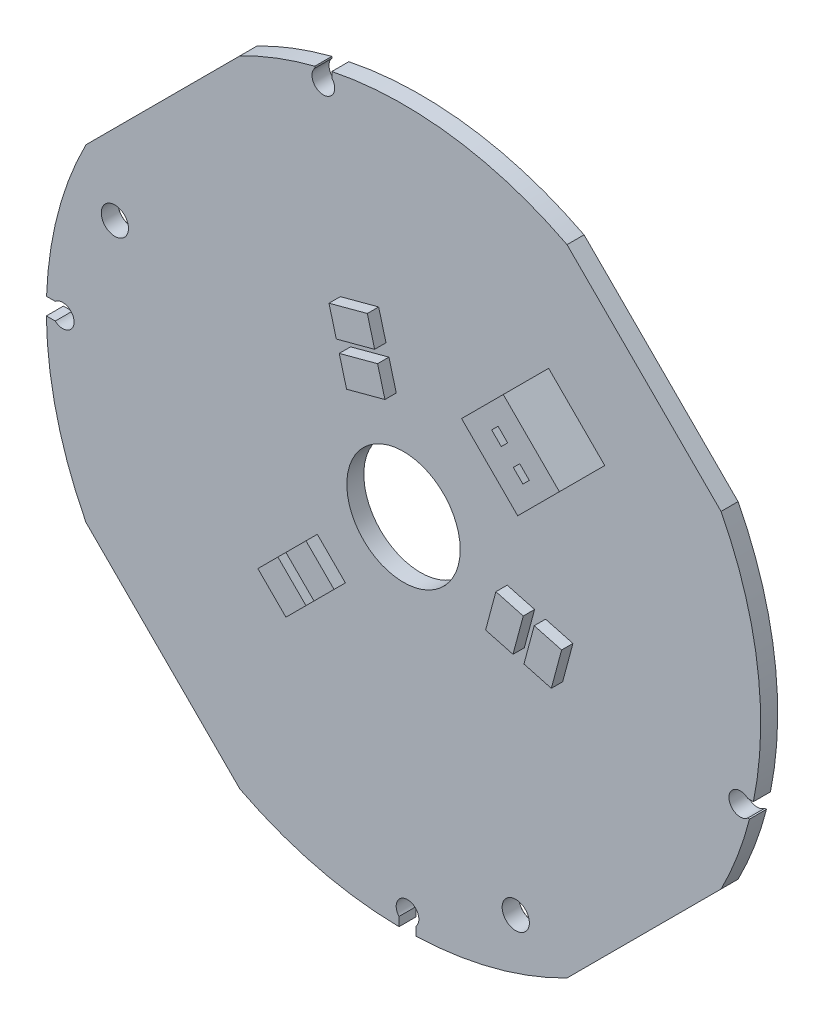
ISO-10303-21;
HEADER;
FILE_DESCRIPTION(('STEP AP214'),'2;1');
FILE_NAME('part.step','',(''),(''),'','','');
FILE_SCHEMA(('AUTOMOTIVE_DESIGN { 1 0 10303 214 1 1 1 1 }'));
ENDSEC;
DATA;
#1=APPLICATION_CONTEXT('core data for automotive mechanical design processes');
#2=APPLICATION_PROTOCOL_DEFINITION('international standard','automotive_design',2000,#1);
#3=PRODUCT_CONTEXT('',#1,'mechanical');
#4=PRODUCT('Part','Part','',(#3));
#5=PRODUCT_RELATED_PRODUCT_CATEGORY('part','',(#4));
#6=PRODUCT_DEFINITION_FORMATION('','',#4);
#7=PRODUCT_DEFINITION_CONTEXT('part definition',#1,'design');
#8=PRODUCT_DEFINITION('design','',#6,#7);
#9=PRODUCT_DEFINITION_SHAPE('','',#8);
#10=(LENGTH_UNIT() NAMED_UNIT(*) SI_UNIT(.MILLI.,.METRE.));
#11=(NAMED_UNIT(*) PLANE_ANGLE_UNIT() SI_UNIT($,.RADIAN.));
#12=(NAMED_UNIT(*) SI_UNIT($,.STERADIAN.) SOLID_ANGLE_UNIT());
#13=UNCERTAINTY_MEASURE_WITH_UNIT(LENGTH_MEASURE(1.E-05),#10,'distance_accuracy_value','');
#14=(GEOMETRIC_REPRESENTATION_CONTEXT(3) GLOBAL_UNCERTAINTY_ASSIGNED_CONTEXT((#13)) GLOBAL_UNIT_ASSIGNED_CONTEXT((#10,
#11,#12)) REPRESENTATION_CONTEXT('',''));
#15=CARTESIAN_POINT('',(0.,0.,0.));
#16=DIRECTION('',(0.,0.,1.));
#17=DIRECTION('',(1.,0.,0.));
#18=AXIS2_PLACEMENT_3D('',#15,#16,#17);
#19=CARTESIAN_POINT('',(0.,0.,1.5));
#20=DIRECTION('',(0.,0.,1.));
#21=DIRECTION('',(1.,0.,0.));
#22=AXIS2_PLACEMENT_3D('',#19,#20,#21);
#23=PLANE('',#22);
#24=CARTESIAN_POINT('',(9.89949493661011,-25.4558441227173,1.5));
#25=DIRECTION('',(0.,0.,1.));
#26=DIRECTION('',(1.,0.,0.));
#27=AXIS2_PLACEMENT_3D('',#24,#25,#26);
#28=CIRCLE('',#27,1.2);
#29=CARTESIAN_POINT('',(11.0994949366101,-25.4558441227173,1.5));
#30=VERTEX_POINT('',#29);
#31=EDGE_CURVE('E40',#30,#30,#28,.T.);
#32=ORIENTED_EDGE('',*,*,#31,.F.);
#33=EDGE_LOOP('',(#32));
#34=FACE_BOUND('',#33,.T.);
#35=CARTESIAN_POINT('',(-25.4558441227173,9.89949493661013,1.5));
#36=DIRECTION('',(0.,0.,1.));
#37=DIRECTION('',(1.,0.,0.));
#38=AXIS2_PLACEMENT_3D('',#35,#36,#37);
#39=CIRCLE('',#38,1.2);
#40=CARTESIAN_POINT('',(-24.2558441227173,9.89949493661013,1.5));
#41=VERTEX_POINT('',#40);
#42=EDGE_CURVE('E499',#41,#41,#39,.T.);
#43=ORIENTED_EDGE('',*,*,#42,.F.);
#44=EDGE_LOOP('',(#43));
#45=FACE_BOUND('',#44,.T.);
#46=CARTESIAN_POINT('',(0.,0.,1.5));
#47=DIRECTION('',(0.,0.,1.));
#48=DIRECTION('',(1.,0.,0.));
#49=AXIS2_PLACEMENT_3D('',#46,#47,#48);
#50=CIRCLE('',#49,5.);
#51=CARTESIAN_POINT('',(5.,0.,1.5));
#52=VERTEX_POINT('',#51);
#53=EDGE_CURVE('E807',#52,#52,#50,.T.);
#54=ORIENTED_EDGE('',*,*,#53,.F.);
#55=EDGE_LOOP('',(#54));
#56=FACE_BOUND('',#55,.T.);
#57=CARTESIAN_POINT('',(0.,0.,1.5));
#58=DIRECTION('',(0.,0.,1.));
#59=DIRECTION('',(1.,0.,0.));
#60=AXIS2_PLACEMENT_3D('',#57,#58,#59);
#61=CIRCLE('',#60,31.5);
#62=CARTESIAN_POINT('',(28.0047422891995,-14.4216645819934,1.5));
#63=VERTEX_POINT('',#62);
#64=CARTESIAN_POINT('',(30.5136182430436,-7.82106781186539,1.49999999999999));
#65=VERTEX_POINT('',#64);
#66=EDGE_CURVE('E843',#63,#65,#61,.T.);
#67=ORIENTED_EDGE('',*,*,#66,.T.);
#68=DIRECTION('',(-1.,0.,0.));
#69=VECTOR('',#68,1.);
#70=CARTESIAN_POINT('',(30.5136182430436,-7.82106781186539,1.49999999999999));
#71=LINE('',#70,#69);
#72=CARTESIAN_POINT('',(30.3599226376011,-7.82106781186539,1.49999999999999));
#73=VERTEX_POINT('',#72);
#74=EDGE_CURVE('E738',#65,#73,#71,.T.);
#75=ORIENTED_EDGE('',*,*,#74,.T.);
#76=CARTESIAN_POINT('',(29.698484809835,-7.07106781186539,1.49999999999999));
#77=DIRECTION('',(0.,0.,-1.));
#78=DIRECTION('',(0.,1.,0.));
#79=AXIS2_PLACEMENT_3D('',#76,#77,#78);
#80=CIRCLE('',#79,0.999999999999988);
#81=CARTESIAN_POINT('',(30.3599226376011,-6.32106781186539,1.49999999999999));
#82=VERTEX_POINT('',#81);
#83=EDGE_CURVE('E747',#73,#82,#80,.T.);
#84=ORIENTED_EDGE('',*,*,#83,.T.);
#85=DIRECTION('',(1.,0.,0.));
#86=VECTOR('',#85,1.);
#87=CARTESIAN_POINT('',(30.859262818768,-6.32106781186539,1.49999999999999));
#88=LINE('',#87,#86);
#89=CARTESIAN_POINT('',(30.859262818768,-6.32106781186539,1.49999999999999));
#90=VERTEX_POINT('',#89);
#91=EDGE_CURVE('E744',#82,#90,#88,.T.);
#92=ORIENTED_EDGE('',*,*,#91,.T.);
#93=CARTESIAN_POINT('',(28.0047422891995,14.4216645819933,1.5));
#94=VERTEX_POINT('',#93);
#95=EDGE_CURVE('E847',#90,#94,#61,.T.);
#96=ORIENTED_EDGE('',*,*,#95,.T.);
#97=DIRECTION('',(-0.707106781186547,0.707106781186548,0.));
#98=VECTOR('',#97,1.);
#99=CARTESIAN_POINT('',(14.4216645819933,28.0047422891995,1.5));
#100=LINE('',#99,#98);
#101=CARTESIAN_POINT('',(14.4216645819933,28.0047422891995,1.5));
#102=VERTEX_POINT('',#101);
#103=EDGE_CURVE('E846',#94,#102,#100,.T.);
#104=ORIENTED_EDGE('',*,*,#103,.T.);
#105=CARTESIAN_POINT('',(0.,0.,1.5));
#106=DIRECTION('',(0.,0.,1.));
#107=DIRECTION('',(1.,0.,0.));
#108=AXIS2_PLACEMENT_3D('',#105,#106,#107);
#109=CIRCLE('',#108,31.5);
#110=CARTESIAN_POINT('',(-6.32106781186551,30.859262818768,1.5));
#111=VERTEX_POINT('',#110);
#112=EDGE_CURVE('E850',#102,#111,#109,.T.);
#113=ORIENTED_EDGE('',*,*,#112,.T.);
#114=DIRECTION('',(0.,1.,0.));
#115=VECTOR('',#114,1.);
#116=CARTESIAN_POINT('',(-6.32106781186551,30.859262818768,1.5));
#117=LINE('',#116,#115);
#118=CARTESIAN_POINT('',(-6.32106781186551,30.3599226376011,1.5));
#119=VERTEX_POINT('',#118);
#120=EDGE_CURVE('E789',#119,#111,#117,.T.);
#121=ORIENTED_EDGE('',*,*,#120,.F.);
#122=CARTESIAN_POINT('',(-7.07106781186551,29.698484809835,1.5));
#123=DIRECTION('',(0.,0.,1.));
#124=DIRECTION('',(1.,0.,0.));
#125=AXIS2_PLACEMENT_3D('',#122,#123,#124);
#126=CIRCLE('',#125,0.999999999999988);
#127=CARTESIAN_POINT('',(-7.82106781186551,30.3599226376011,1.5));
#128=VERTEX_POINT('',#127);
#129=EDGE_CURVE('E799',#128,#119,#126,.T.);
#130=ORIENTED_EDGE('',*,*,#129,.F.);
#131=DIRECTION('',(0.,-1.,0.));
#132=VECTOR('',#131,1.);
#133=CARTESIAN_POINT('',(-7.82106781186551,30.5136182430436,1.5));
#134=LINE('',#133,#132);
#135=CARTESIAN_POINT('',(-7.82106781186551,30.5136182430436,1.5));
#136=VERTEX_POINT('',#135);
#137=EDGE_CURVE('E796',#136,#128,#134,.T.);
#138=ORIENTED_EDGE('',*,*,#137,.F.);
#139=CARTESIAN_POINT('',(-14.4216645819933,28.0047422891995,1.5));
#140=VERTEX_POINT('',#139);
#141=EDGE_CURVE('E849',#136,#140,#109,.T.);
#142=ORIENTED_EDGE('',*,*,#141,.T.);
#143=DIRECTION('',(-0.707106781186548,-0.707106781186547,0.));
#144=VECTOR('',#143,1.);
#145=CARTESIAN_POINT('',(-14.4216645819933,28.0047422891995,1.5));
#146=LINE('',#145,#144);
#147=CARTESIAN_POINT('',(-28.0047422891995,14.4216645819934,1.5));
#148=VERTEX_POINT('',#147);
#149=EDGE_CURVE('E853',#140,#148,#146,.T.);
#150=ORIENTED_EDGE('',*,*,#149,.T.);
#151=CARTESIAN_POINT('',(0.,0.,1.5));
#152=DIRECTION('',(0.,0.,1.));
#153=DIRECTION('',(1.,0.,0.));
#154=AXIS2_PLACEMENT_3D('',#151,#152,#153);
#155=CIRCLE('',#154,31.5);
#156=CARTESIAN_POINT('',(-31.480663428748,1.10355339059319,1.5));
#157=VERTEX_POINT('',#156);
#158=EDGE_CURVE('E856',#148,#157,#155,.T.);
#159=ORIENTED_EDGE('',*,*,#158,.T.);
#160=DIRECTION('',(-1.,0.,0.));
#161=VECTOR('',#160,1.);
#162=CARTESIAN_POINT('',(-30.7134760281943,1.10355339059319,1.5));
#163=LINE('',#162,#161);
#164=CARTESIAN_POINT('',(-30.7134760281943,1.10355339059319,1.5));
#165=VERTEX_POINT('',#164);
#166=EDGE_CURVE('E817',#165,#157,#163,.T.);
#167=ORIENTED_EDGE('',*,*,#166,.F.);
#168=CARTESIAN_POINT('',(-30.0520382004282,0.353553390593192,1.5));
#169=DIRECTION('',(0.,0.,1.));
#170=DIRECTION('',(1.,0.,0.));
#171=AXIS2_PLACEMENT_3D('',#168,#169,#170);
#172=CIRCLE('',#171,0.999999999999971);
#173=CARTESIAN_POINT('',(-30.7134760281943,-0.396446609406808,1.5));
#174=VERTEX_POINT('',#173);
#175=EDGE_CURVE('E826',#174,#165,#172,.T.);
#176=ORIENTED_EDGE('',*,*,#175,.F.);
#177=DIRECTION('',(1.,0.,0.));
#178=VECTOR('',#177,1.);
#179=CARTESIAN_POINT('',(-30.7134760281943,-0.396446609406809,1.5));
#180=LINE('',#179,#178);
#181=CARTESIAN_POINT('',(-31.4975051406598,-0.396446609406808,1.5));
#182=VERTEX_POINT('',#181);
#183=EDGE_CURVE('E756',#182,#174,#180,.T.);
#184=ORIENTED_EDGE('',*,*,#183,.F.);
#185=CARTESIAN_POINT('',(-28.0047422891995,-14.4216645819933,1.5));
#186=VERTEX_POINT('',#185);
#187=EDGE_CURVE('E855',#182,#186,#155,.T.);
#188=ORIENTED_EDGE('',*,*,#187,.T.);
#189=DIRECTION('',(0.707106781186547,-0.707106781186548,0.));
#190=VECTOR('',#189,1.);
#191=CARTESIAN_POINT('',(-28.0047422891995,-14.4216645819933,1.5));
#192=LINE('',#191,#190);
#193=CARTESIAN_POINT('',(-14.4216645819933,-28.0047422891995,1.5));
#194=VERTEX_POINT('',#193);
#195=EDGE_CURVE('E859',#186,#194,#192,.T.);
#196=ORIENTED_EDGE('',*,*,#195,.T.);
#197=CARTESIAN_POINT('',(0.,0.,1.5));
#198=DIRECTION('',(0.,0.,1.));
#199=DIRECTION('',(1.,0.,0.));
#200=AXIS2_PLACEMENT_3D('',#197,#198,#199);
#201=CIRCLE('',#200,31.5);
#202=CARTESIAN_POINT('',(-0.396446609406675,-31.4975051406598,1.49999999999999));
#203=VERTEX_POINT('',#202);
#204=EDGE_CURVE('E862',#194,#203,#201,.T.);
#205=ORIENTED_EDGE('',*,*,#204,.T.);
#206=DIRECTION('',(0.,1.,0.));
#207=VECTOR('',#206,1.);
#208=CARTESIAN_POINT('',(-0.396446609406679,-30.7134760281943,1.49999999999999));
#209=LINE('',#208,#207);
#210=CARTESIAN_POINT('',(-0.396446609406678,-30.7134760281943,1.49999999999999));
#211=VERTEX_POINT('',#210);
#212=EDGE_CURVE('E765',#203,#211,#209,.T.);
#213=ORIENTED_EDGE('',*,*,#212,.T.);
#214=CARTESIAN_POINT('',(0.353553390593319,-30.0520382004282,1.49999999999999));
#215=DIRECTION('',(0.,0.,-1.));
#216=DIRECTION('',(0.,1.,0.));
#217=AXIS2_PLACEMENT_3D('',#214,#215,#216);
#218=CIRCLE('',#217,0.999999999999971);
#219=CARTESIAN_POINT('',(1.10355339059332,-30.7134760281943,1.49999999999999));
#220=VERTEX_POINT('',#219);
#221=EDGE_CURVE('E773',#211,#220,#218,.T.);
#222=ORIENTED_EDGE('',*,*,#221,.T.);
#223=DIRECTION('',(0.,-1.,0.));
#224=VECTOR('',#223,1.);
#225=CARTESIAN_POINT('',(1.10355339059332,-30.7134760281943,1.49999999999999));
#226=LINE('',#225,#224);
#227=CARTESIAN_POINT('',(1.10355339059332,-31.480663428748,1.49999999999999));
#228=VERTEX_POINT('',#227);
#229=EDGE_CURVE('E734',#220,#228,#226,.T.);
#230=ORIENTED_EDGE('',*,*,#229,.T.);
#231=CARTESIAN_POINT('',(14.4216645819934,-28.0047422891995,1.5));
#232=VERTEX_POINT('',#231);
#233=EDGE_CURVE('E861',#228,#232,#201,.T.);
#234=ORIENTED_EDGE('',*,*,#233,.T.);
#235=DIRECTION('',(0.707106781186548,0.707106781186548,0.));
#236=VECTOR('',#235,1.);
#237=CARTESIAN_POINT('',(28.0047422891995,-14.4216645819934,1.5));
#238=LINE('',#237,#236);
#239=EDGE_CURVE('E865',#232,#63,#238,.T.);
#240=ORIENTED_EDGE('',*,*,#239,.T.);
#241=EDGE_LOOP('',(#67,#75,#84,#92,#96,#104,#113,#121,#130,#138,#142,#150,#159,#167,#176,#184,
#188,#196,#205,#213,#222,#230,#234,#240));
#242=FACE_BOUND('',#241,.T.);
#243=DIRECTION('',(-0.707106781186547,-0.707106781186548,0.));
#244=VECTOR('',#243,1.);
#245=CARTESIAN_POINT('',(-7.60139789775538,-5.12652416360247,1.5));
#246=LINE('',#245,#244);
#247=CARTESIAN_POINT('',(-7.60139789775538,-5.12652416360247,1.5));
#248=VERTEX_POINT('',#247);
#249=CARTESIAN_POINT('',(-9.36916485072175,-6.89429111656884,1.5));
#250=VERTEX_POINT('',#249);
#251=EDGE_CURVE('E719',#248,#250,#246,.T.);
#252=ORIENTED_EDGE('',*,*,#251,.F.);
#253=DIRECTION('',(-0.707106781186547,0.707106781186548,0.));
#254=VECTOR('',#253,1.);
#255=CARTESIAN_POINT('',(-7.60139789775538,-5.12652416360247,1.5));
#256=LINE('',#255,#254);
#257=CARTESIAN_POINT('',(-5.12652416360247,-7.60139789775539,1.5));
#258=VERTEX_POINT('',#257);
#259=EDGE_CURVE('E705',#258,#248,#256,.T.);
#260=ORIENTED_EDGE('',*,*,#259,.F.);
#261=DIRECTION('',(0.707106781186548,0.707106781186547,0.));
#262=VECTOR('',#261,1.);
#263=CARTESIAN_POINT('',(-5.12652416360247,-7.60139789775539,1.5));
#264=LINE('',#263,#262);
#265=CARTESIAN_POINT('',(-6.89429111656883,-9.36916485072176,1.5));
#266=VERTEX_POINT('',#265);
#267=EDGE_CURVE('E710',#266,#258,#264,.T.);
#268=ORIENTED_EDGE('',*,*,#267,.F.);
#269=DIRECTION('',(0.707106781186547,-0.707106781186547,0.));
#270=VECTOR('',#269,1.);
#271=CARTESIAN_POINT('',(-9.36916485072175,-6.89429111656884,1.5));
#272=LINE('',#271,#270);
#273=EDGE_CURVE('E721',#250,#266,#272,.T.);
#274=ORIENTED_EDGE('',*,*,#273,.F.);
#275=EDGE_LOOP('',(#252,#260,#268,#274));
#276=FACE_BOUND('',#275,.T.);
#277=DIRECTION('',(0.707106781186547,-0.707106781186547,0.));
#278=VECTOR('',#277,1.);
#279=CARTESIAN_POINT('',(-11.8440385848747,-9.36916485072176,1.5));
#280=LINE('',#279,#278);
#281=CARTESIAN_POINT('',(-11.8440385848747,-9.36916485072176,1.5));
#282=VERTEX_POINT('',#281);
#283=CARTESIAN_POINT('',(-9.36916485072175,-11.8440385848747,1.5));
#284=VERTEX_POINT('',#283);
#285=EDGE_CURVE('E690',#282,#284,#280,.T.);
#286=ORIENTED_EDGE('',*,*,#285,.F.);
#287=DIRECTION('',(-0.707106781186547,-0.707106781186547,0.));
#288=VECTOR('',#287,1.);
#289=CARTESIAN_POINT('',(-11.8440385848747,-9.36916485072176,1.5));
#290=LINE('',#289,#288);
#291=CARTESIAN_POINT('',(-10.0762716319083,-7.60139789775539,1.5));
#292=VERTEX_POINT('',#291);
#293=EDGE_CURVE('E676',#292,#282,#290,.T.);
#294=ORIENTED_EDGE('',*,*,#293,.F.);
#295=DIRECTION('',(-0.707106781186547,0.707106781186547,0.));
#296=VECTOR('',#295,1.);
#297=CARTESIAN_POINT('',(-10.0762716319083,-7.60139789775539,1.5));
#298=LINE('',#297,#296);
#299=CARTESIAN_POINT('',(-7.60139789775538,-10.0762716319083,1.5));
#300=VERTEX_POINT('',#299);
#301=EDGE_CURVE('E681',#300,#292,#298,.T.);
#302=ORIENTED_EDGE('',*,*,#301,.F.);
#303=DIRECTION('',(0.707106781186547,0.707106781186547,0.));
#304=VECTOR('',#303,1.);
#305=CARTESIAN_POINT('',(-9.36916485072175,-11.8440385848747,1.5));
#306=LINE('',#305,#304);
#307=EDGE_CURVE('E692',#284,#300,#306,.T.);
#308=ORIENTED_EDGE('',*,*,#307,.F.);
#309=EDGE_LOOP('',(#286,#294,#302,#308));
#310=FACE_BOUND('',#309,.T.);
#311=DIRECTION('',(0.96592582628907,-0.258819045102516,0.));
#312=VECTOR('',#311,1.);
#313=CARTESIAN_POINT('',(8.24039910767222,-4.01974160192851,1.5));
#314=LINE('',#313,#312);
#315=CARTESIAN_POINT('',(8.24039910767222,-4.01974160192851,1.5));
#316=VERTEX_POINT('',#315);
#317=CARTESIAN_POINT('',(10.6552136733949,-4.6667892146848,1.5));
#318=VERTEX_POINT('',#317);
#319=EDGE_CURVE('E661',#316,#318,#314,.T.);
#320=ORIENTED_EDGE('',*,*,#319,.F.);
#321=DIRECTION('',(-0.258819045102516,-0.96592582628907,0.));
#322=VECTOR('',#321,1.);
#323=CARTESIAN_POINT('',(8.24039910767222,-4.01974160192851,1.5));
#324=LINE('',#323,#322);
#325=CARTESIAN_POINT('',(9.14626576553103,-0.63900120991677,1.5));
#326=VERTEX_POINT('',#325);
#327=EDGE_CURVE('E647',#326,#316,#324,.T.);
#328=ORIENTED_EDGE('',*,*,#327,.F.);
#329=DIRECTION('',(-0.96592582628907,0.258819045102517,0.));
#330=VECTOR('',#329,1.);
#331=CARTESIAN_POINT('',(9.14626576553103,-0.63900120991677,1.5));
#332=LINE('',#331,#330);
#333=CARTESIAN_POINT('',(11.5610803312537,-1.28604882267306,1.5));
#334=VERTEX_POINT('',#333);
#335=EDGE_CURVE('E652',#334,#326,#332,.T.);
#336=ORIENTED_EDGE('',*,*,#335,.F.);
#337=DIRECTION('',(0.258819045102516,0.96592582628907,0.));
#338=VECTOR('',#337,1.);
#339=CARTESIAN_POINT('',(10.6552136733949,-4.6667892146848,1.5));
#340=LINE('',#339,#338);
#341=EDGE_CURVE('E663',#318,#334,#340,.T.);
#342=ORIENTED_EDGE('',*,*,#341,.F.);
#343=EDGE_LOOP('',(#320,#328,#336,#342));
#344=FACE_BOUND('',#343,.T.);
#345=DIRECTION('',(0.258819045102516,0.96592582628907,0.));
#346=VECTOR('',#345,1.);
#347=CARTESIAN_POINT('',(14.0359540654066,-5.57265587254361,1.5));
#348=LINE('',#347,#346);
#349=CARTESIAN_POINT('',(14.0359540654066,-5.57265587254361,1.5));
#350=VERTEX_POINT('',#349);
#351=CARTESIAN_POINT('',(14.9418207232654,-2.19191548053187,1.5));
#352=VERTEX_POINT('',#351);
#353=EDGE_CURVE('E632',#350,#352,#348,.T.);
#354=ORIENTED_EDGE('',*,*,#353,.F.);
#355=DIRECTION('',(0.96592582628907,-0.258819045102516,0.));
#356=VECTOR('',#355,1.);
#357=CARTESIAN_POINT('',(14.0359540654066,-5.57265587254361,1.5));
#358=LINE('',#357,#356);
#359=CARTESIAN_POINT('',(11.621139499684,-4.92560825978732,1.5));
#360=VERTEX_POINT('',#359);
#361=EDGE_CURVE('E618',#360,#350,#358,.T.);
#362=ORIENTED_EDGE('',*,*,#361,.F.);
#363=DIRECTION('',(-0.258819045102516,-0.96592582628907,0.));
#364=VECTOR('',#363,1.);
#365=CARTESIAN_POINT('',(11.621139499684,-4.92560825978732,1.5));
#366=LINE('',#365,#364);
#367=CARTESIAN_POINT('',(12.5270061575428,-1.54486786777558,1.5));
#368=VERTEX_POINT('',#367);
#369=EDGE_CURVE('E623',#368,#360,#366,.T.);
#370=ORIENTED_EDGE('',*,*,#369,.F.);
#371=DIRECTION('',(-0.96592582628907,0.258819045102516,0.));
#372=VECTOR('',#371,1.);
#373=CARTESIAN_POINT('',(14.9418207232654,-2.19191548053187,1.5));
#374=LINE('',#373,#372);
#375=EDGE_CURVE('E634',#352,#368,#374,.T.);
#376=ORIENTED_EDGE('',*,*,#375,.F.);
#377=EDGE_LOOP('',(#354,#362,#370,#376));
#378=FACE_BOUND('',#377,.T.);
#379=DIRECTION('',(-0.25881904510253,0.965925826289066,0.));
#380=VECTOR('',#379,1.);
#381=CARTESIAN_POINT('',(-0.639001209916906,9.14626576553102,1.5));
#382=LINE('',#381,#380);
#383=CARTESIAN_POINT('',(-0.639001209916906,9.14626576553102,1.5));
#384=VERTEX_POINT('',#383);
#385=CARTESIAN_POINT('',(-1.28604882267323,11.5610803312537,1.5));
#386=VERTEX_POINT('',#385);
#387=EDGE_CURVE('E603',#384,#386,#382,.T.);
#388=ORIENTED_EDGE('',*,*,#387,.F.);
#389=DIRECTION('',(0.965925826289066,0.25881904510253,0.));
#390=VECTOR('',#389,1.);
#391=CARTESIAN_POINT('',(-0.639001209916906,9.14626576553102,1.5));
#392=LINE('',#391,#390);
#393=CARTESIAN_POINT('',(-4.01974160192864,8.24039910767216,1.5));
#394=VERTEX_POINT('',#393);
#395=EDGE_CURVE('E589',#394,#384,#392,.T.);
#396=ORIENTED_EDGE('',*,*,#395,.F.);
#397=DIRECTION('',(0.258819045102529,-0.965925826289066,0.));
#398=VECTOR('',#397,1.);
#399=CARTESIAN_POINT('',(-4.01974160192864,8.24039910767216,1.5));
#400=LINE('',#399,#398);
#401=CARTESIAN_POINT('',(-4.66678921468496,10.6552136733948,1.5));
#402=VERTEX_POINT('',#401);
#403=EDGE_CURVE('E594',#402,#394,#400,.T.);
#404=ORIENTED_EDGE('',*,*,#403,.F.);
#405=DIRECTION('',(-0.965925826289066,-0.25881904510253,0.));
#406=VECTOR('',#405,1.);
#407=CARTESIAN_POINT('',(-1.28604882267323,11.5610803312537,1.5));
#408=LINE('',#407,#406);
#409=EDGE_CURVE('E605',#386,#402,#408,.T.);
#410=ORIENTED_EDGE('',*,*,#409,.F.);
#411=EDGE_LOOP('',(#388,#396,#404,#410));
#412=FACE_BOUND('',#411,.T.);
#413=DIRECTION('',(-0.965925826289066,-0.25881904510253,0.));
#414=VECTOR('',#413,1.);
#415=CARTESIAN_POINT('',(-2.19191548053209,14.9418207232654,1.5));
#416=LINE('',#415,#414);
#417=CARTESIAN_POINT('',(-2.19191548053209,14.9418207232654,1.5));
#418=VERTEX_POINT('',#417);
#419=CARTESIAN_POINT('',(-5.57265587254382,14.0359540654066,1.5));
#420=VERTEX_POINT('',#419);
#421=EDGE_CURVE('E574',#418,#420,#416,.T.);
#422=ORIENTED_EDGE('',*,*,#421,.F.);
#423=DIRECTION('',(-0.25881904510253,0.965925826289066,0.));
#424=VECTOR('',#423,1.);
#425=CARTESIAN_POINT('',(-2.19191548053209,14.9418207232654,1.5));
#426=LINE('',#425,#424);
#427=CARTESIAN_POINT('',(-1.54486786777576,12.5270061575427,1.5));
#428=VERTEX_POINT('',#427);
#429=EDGE_CURVE('E560',#428,#418,#426,.T.);
#430=ORIENTED_EDGE('',*,*,#429,.F.);
#431=DIRECTION('',(0.965925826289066,0.25881904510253,0.));
#432=VECTOR('',#431,1.);
#433=CARTESIAN_POINT('',(-1.54486786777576,12.5270061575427,1.5));
#434=LINE('',#433,#432);
#435=CARTESIAN_POINT('',(-4.92560825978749,11.6211394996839,1.5));
#436=VERTEX_POINT('',#435);
#437=EDGE_CURVE('E565',#436,#428,#434,.T.);
#438=ORIENTED_EDGE('',*,*,#437,.F.);
#439=DIRECTION('',(0.25881904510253,-0.965925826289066,0.));
#440=VECTOR('',#439,1.);
#441=CARTESIAN_POINT('',(-5.57265587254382,14.0359540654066,1.5));
#442=LINE('',#441,#440);
#443=EDGE_CURVE('E576',#420,#436,#442,.T.);
#444=ORIENTED_EDGE('',*,*,#443,.F.);
#445=EDGE_LOOP('',(#422,#430,#438,#444));
#446=FACE_BOUND('',#445,.T.);
#447=DIRECTION('',(0.707106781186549,-0.707106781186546,0.));
#448=VECTOR('',#447,1.);
#449=CARTESIAN_POINT('',(9.12167747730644,14.0714249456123,1.5));
#450=LINE('',#449,#448);
#451=CARTESIAN_POINT('',(9.12167747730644,14.0714249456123,1.5));
#452=VERTEX_POINT('',#451);
#453=CARTESIAN_POINT('',(14.0714249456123,9.12167747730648,1.5));
#454=VERTEX_POINT('',#453);
#455=EDGE_CURVE('E526',#452,#454,#450,.T.);
#456=ORIENTED_EDGE('',*,*,#455,.F.);
#457=DIRECTION('',(-0.707106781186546,-0.707106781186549,0.));
#458=VECTOR('',#457,1.);
#459=CARTESIAN_POINT('',(12.7986327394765,17.7483802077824,1.5));
#460=LINE('',#459,#458);
#461=CARTESIAN_POINT('',(12.7986327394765,17.7483802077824,1.5));
#462=VERTEX_POINT('',#461);
#463=EDGE_CURVE('E479',#462,#452,#460,.T.);
#464=ORIENTED_EDGE('',*,*,#463,.F.);
#465=DIRECTION('',(-0.707106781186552,0.707106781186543,0.));
#466=VECTOR('',#465,1.);
#467=CARTESIAN_POINT('',(13.505739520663,17.0412734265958,1.5));
#468=LINE('',#467,#466);
#469=CARTESIAN_POINT('',(17.7483802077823,12.7986327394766,1.5));
#470=VERTEX_POINT('',#469);
#471=EDGE_CURVE('E517',#470,#462,#468,.T.);
#472=ORIENTED_EDGE('',*,*,#471,.F.);
#473=DIRECTION('',(0.707106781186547,0.707106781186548,0.));
#474=VECTOR('',#473,1.);
#475=CARTESIAN_POINT('',(14.0714249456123,9.12167747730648,1.5));
#476=LINE('',#475,#474);
#477=EDGE_CURVE('E528',#454,#470,#476,.T.);
#478=ORIENTED_EDGE('',*,*,#477,.F.);
#479=EDGE_LOOP('',(#456,#464,#472,#478));
#480=FACE_BOUND('',#479,.T.);
#481=ADVANCED_FACE('F36',(#34,#45,#56,#242,#276,#310,#344,#378,#412,#446,#480),#23,.T.);
#482=CARTESIAN_POINT('',(0.,0.,1.5));
#483=DIRECTION('',(0.,0.,-1.));
#484=DIRECTION('',(-1.,0.,0.));
#485=AXIS2_PLACEMENT_3D('',#482,#483,#484);
#486=CYLINDRICAL_SURFACE('',#485,31.5);
#487=DIRECTION('',(0.,0.,1.));
#488=VECTOR('',#487,1.);
#489=CARTESIAN_POINT('',(30.5136182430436,-7.82106781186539,0.));
#490=LINE('',#489,#488);
#491=CARTESIAN_POINT('',(30.5136182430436,-7.82106781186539,0.));
#492=VERTEX_POINT('',#491);
#493=EDGE_CURVE('E753',#492,#65,#490,.T.);
#494=ORIENTED_EDGE('',*,*,#493,.T.);
#495=ORIENTED_EDGE('',*,*,#66,.F.);
#496=DIRECTION('',(0.,0.,-1.));
#497=VECTOR('',#496,1.);
#498=CARTESIAN_POINT('',(28.0047422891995,-14.4216645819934,1.5));
#499=LINE('',#498,#497);
#500=CARTESIAN_POINT('',(28.0047422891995,-14.4216645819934,0.));
#501=VERTEX_POINT('',#500);
#502=EDGE_CURVE('E867',#63,#501,#499,.T.);
#503=ORIENTED_EDGE('',*,*,#502,.T.);
#504=CARTESIAN_POINT('',(0.,0.,0.));
#505=DIRECTION('',(0.,0.,1.));
#506=DIRECTION('',(1.,0.,0.));
#507=AXIS2_PLACEMENT_3D('',#504,#505,#506);
#508=CIRCLE('',#507,31.5);
#509=EDGE_CURVE('E868',#501,#492,#508,.T.);
#510=ORIENTED_EDGE('',*,*,#509,.T.);
#511=EDGE_LOOP('',(#494,#495,#503,#510));
#512=FACE_BOUND('',#511,.T.);
#513=ADVANCED_FACE('F38',(#512),#486,.T.);
#514=DIRECTION('',(0.,0.,1.));
#515=VECTOR('',#514,1.);
#516=CARTESIAN_POINT('',(30.859262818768,-6.32106781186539,0.));
#517=LINE('',#516,#515);
#518=CARTESIAN_POINT('',(30.859262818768,-6.32106781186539,0.));
#519=VERTEX_POINT('',#518);
#520=EDGE_CURVE('E743',#519,#90,#517,.T.);
#521=ORIENTED_EDGE('',*,*,#520,.F.);
#522=CARTESIAN_POINT('',(28.0047422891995,14.4216645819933,0.));
#523=VERTEX_POINT('',#522);
#524=EDGE_CURVE('E840',#519,#523,#508,.T.);
#525=ORIENTED_EDGE('',*,*,#524,.T.);
#526=DIRECTION('',(0.,0.,-1.));
#527=VECTOR('',#526,1.);
#528=CARTESIAN_POINT('',(28.0047422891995,14.4216645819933,1.5));
#529=LINE('',#528,#527);
#530=EDGE_CURVE('E911',#94,#523,#529,.T.);
#531=ORIENTED_EDGE('',*,*,#530,.F.);
#532=ORIENTED_EDGE('',*,*,#95,.F.);
#533=EDGE_LOOP('',(#521,#525,#531,#532));
#534=FACE_BOUND('',#533,.T.);
#535=ADVANCED_FACE('F1045',(#534),#486,.T.);
#536=CARTESIAN_POINT('',(0.,0.,1.5));
#537=DIRECTION('',(0.,0.,-1.));
#538=DIRECTION('',(-1.,0.,0.));
#539=AXIS2_PLACEMENT_3D('',#536,#537,#538);
#540=CYLINDRICAL_SURFACE('',#539,31.5);
#541=DIRECTION('',(0.,0.,1.));
#542=VECTOR('',#541,1.);
#543=CARTESIAN_POINT('',(-0.396446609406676,-31.4975051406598,0.));
#544=LINE('',#543,#542);
#545=CARTESIAN_POINT('',(-0.396446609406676,-31.4975051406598,0.));
#546=VERTEX_POINT('',#545);
#547=EDGE_CURVE('E748',#546,#203,#544,.T.);
#548=ORIENTED_EDGE('',*,*,#547,.T.);
#549=ORIENTED_EDGE('',*,*,#204,.F.);
#550=DIRECTION('',(0.,0.,-1.));
#551=VECTOR('',#550,1.);
#552=CARTESIAN_POINT('',(-14.4216645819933,-28.0047422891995,1.5));
#553=LINE('',#552,#551);
#554=CARTESIAN_POINT('',(-14.4216645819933,-28.0047422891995,0.));
#555=VERTEX_POINT('',#554);
#556=EDGE_CURVE('E896',#194,#555,#553,.T.);
#557=ORIENTED_EDGE('',*,*,#556,.T.);
#558=CARTESIAN_POINT('',(0.,0.,0.));
#559=DIRECTION('',(0.,0.,1.));
#560=DIRECTION('',(1.,0.,0.));
#561=AXIS2_PLACEMENT_3D('',#558,#559,#560);
#562=CIRCLE('',#561,31.5);
#563=EDGE_CURVE('E886',#555,#546,#562,.T.);
#564=ORIENTED_EDGE('',*,*,#563,.T.);
#565=EDGE_LOOP('',(#548,#549,#557,#564));
#566=FACE_BOUND('',#565,.T.);
#567=ADVANCED_FACE('F986',(#566),#540,.T.);
#568=DIRECTION('',(0.,0.,1.));
#569=VECTOR('',#568,1.);
#570=CARTESIAN_POINT('',(1.10355339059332,-31.480663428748,0.));
#571=LINE('',#570,#569);
#572=CARTESIAN_POINT('',(1.10355339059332,-31.480663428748,0.));
#573=VERTEX_POINT('',#572);
#574=EDGE_CURVE('E770',#573,#228,#571,.T.);
#575=ORIENTED_EDGE('',*,*,#574,.F.);
#576=CARTESIAN_POINT('',(14.4216645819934,-28.0047422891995,0.));
#577=VERTEX_POINT('',#576);
#578=EDGE_CURVE('E885',#573,#577,#562,.T.);
#579=ORIENTED_EDGE('',*,*,#578,.T.);
#580=DIRECTION('',(0.,0.,-1.));
#581=VECTOR('',#580,1.);
#582=CARTESIAN_POINT('',(14.4216645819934,-28.0047422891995,1.5));
#583=LINE('',#582,#581);
#584=EDGE_CURVE('E893',#232,#577,#583,.T.);
#585=ORIENTED_EDGE('',*,*,#584,.F.);
#586=ORIENTED_EDGE('',*,*,#233,.F.);
#587=EDGE_LOOP('',(#575,#579,#585,#586));
#588=FACE_BOUND('',#587,.T.);
#589=ADVANCED_FACE('F946',(#588),#540,.T.);
#590=CARTESIAN_POINT('',(0.,0.,0.));
#591=DIRECTION('',(0.,0.,1.));
#592=DIRECTION('',(1.,0.,0.));
#593=AXIS2_PLACEMENT_3D('',#590,#591,#592);
#594=PLANE('',#593);
#595=CARTESIAN_POINT('',(9.89949493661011,-25.4558441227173,0.));
#596=DIRECTION('',(0.,0.,-1.));
#597=DIRECTION('',(-1.,0.,0.));
#598=AXIS2_PLACEMENT_3D('',#595,#596,#597);
#599=CIRCLE('',#598,1.225);
#600=CARTESIAN_POINT('',(8.67449493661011,-25.4558441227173,0.));
#601=VERTEX_POINT('',#600);
#602=EDGE_CURVE('E936',#601,#601,#599,.T.);
#603=ORIENTED_EDGE('',*,*,#602,.F.);
#604=EDGE_LOOP('',(#603));
#605=FACE_BOUND('',#604,.T.);
#606=CARTESIAN_POINT('',(-25.4558441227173,9.89949493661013,0.));
#607=DIRECTION('',(0.,0.,-1.));
#608=DIRECTION('',(-1.,0.,0.));
#609=AXIS2_PLACEMENT_3D('',#606,#607,#608);
#610=CIRCLE('',#609,1.225);
#611=CARTESIAN_POINT('',(-26.6808441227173,9.89949493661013,0.));
#612=VERTEX_POINT('',#611);
#613=EDGE_CURVE('E925',#612,#612,#610,.T.);
#614=ORIENTED_EDGE('',*,*,#613,.F.);
#615=EDGE_LOOP('',(#614));
#616=FACE_BOUND('',#615,.T.);
#617=DIRECTION('',(-0.707106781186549,0.707106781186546,0.));
#618=VECTOR('',#617,1.);
#619=CARTESIAN_POINT('',(14.2128463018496,14.2128463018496,0.));
#620=LINE('',#619,#618);
#621=CARTESIAN_POINT('',(15.980613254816,12.4450793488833,0.));
#622=VERTEX_POINT('',#621);
#623=CARTESIAN_POINT('',(12.4450793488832,15.980613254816,0.));
#624=VERTEX_POINT('',#623);
#625=EDGE_CURVE('E45',#622,#624,#620,.T.);
#626=ORIENTED_EDGE('',*,*,#625,.T.);
#627=DIRECTION('',(-0.707106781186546,-0.707106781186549,0.));
#628=VECTOR('',#627,1.);
#629=CARTESIAN_POINT('',(-1.76776695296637,1.76776695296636,0.));
#630=LINE('',#629,#628);
#631=CARTESIAN_POINT('',(10.8894444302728,14.4249783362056,0.));
#632=VERTEX_POINT('',#631);
#633=EDGE_CURVE('E12',#624,#632,#630,.T.);
#634=ORIENTED_EDGE('',*,*,#633,.T.);
#635=DIRECTION('',(0.707106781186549,-0.707106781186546,0.));
#636=VECTOR('',#635,1.);
#637=CARTESIAN_POINT('',(12.6572113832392,12.6572113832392,0.));
#638=LINE('',#637,#636);
#639=CARTESIAN_POINT('',(14.4249783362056,10.8894444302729,0.));
#640=VERTEX_POINT('',#639);
#641=EDGE_CURVE('E914',#632,#640,#638,.T.);
#642=ORIENTED_EDGE('',*,*,#641,.T.);
#643=DIRECTION('',(0.707106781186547,0.707106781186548,0.));
#644=VECTOR('',#643,1.);
#645=CARTESIAN_POINT('',(1.76776695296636,-1.76776695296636,0.));
#646=LINE('',#645,#644);
#647=EDGE_CURVE('E917',#640,#622,#646,.T.);
#648=ORIENTED_EDGE('',*,*,#647,.T.);
#649=EDGE_LOOP('',(#626,#634,#642,#648));
#650=FACE_BOUND('',#649,.T.);
#651=CARTESIAN_POINT('',(0.,0.,0.));
#652=DIRECTION('',(0.,0.,1.));
#653=DIRECTION('',(1.,0.,0.));
#654=AXIS2_PLACEMENT_3D('',#651,#652,#653);
#655=CIRCLE('',#654,5.);
#656=CARTESIAN_POINT('',(5.,0.,0.));
#657=VERTEX_POINT('',#656);
#658=EDGE_CURVE('E837',#657,#657,#655,.T.);
#659=ORIENTED_EDGE('',*,*,#658,.T.);
#660=EDGE_LOOP('',(#659));
#661=FACE_BOUND('',#660,.T.);
#662=DIRECTION('',(-1.,0.,0.));
#663=VECTOR('',#662,1.);
#664=CARTESIAN_POINT('',(30.5136182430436,-7.82106781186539,0.));
#665=LINE('',#664,#663);
#666=CARTESIAN_POINT('',(30.3599226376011,-7.82106781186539,0.));
#667=VERTEX_POINT('',#666);
#668=EDGE_CURVE('E741',#492,#667,#665,.T.);
#669=ORIENTED_EDGE('',*,*,#668,.F.);
#670=ORIENTED_EDGE('',*,*,#509,.F.);
#671=DIRECTION('',(0.707106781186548,0.707106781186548,0.));
#672=VECTOR('',#671,1.);
#673=CARTESIAN_POINT('',(28.0047422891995,-14.4216645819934,0.));
#674=LINE('',#673,#672);
#675=EDGE_CURVE('E889',#577,#501,#674,.T.);
#676=ORIENTED_EDGE('',*,*,#675,.F.);
#677=ORIENTED_EDGE('',*,*,#578,.F.);
#678=DIRECTION('',(0.,-1.,0.));
#679=VECTOR('',#678,1.);
#680=CARTESIAN_POINT('',(1.10355339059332,-30.7134760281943,0.));
#681=LINE('',#680,#679);
#682=CARTESIAN_POINT('',(1.10355339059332,-30.7134760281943,0.));
#683=VERTEX_POINT('',#682);
#684=EDGE_CURVE('E762',#683,#573,#681,.T.);
#685=ORIENTED_EDGE('',*,*,#684,.F.);
#686=CARTESIAN_POINT('',(0.353553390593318,-30.0520382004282,0.));
#687=DIRECTION('',(0.,0.,-1.));
#688=DIRECTION('',(0.,1.,0.));
#689=AXIS2_PLACEMENT_3D('',#686,#687,#688);
#690=CIRCLE('',#689,0.999999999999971);
#691=CARTESIAN_POINT('',(-0.396446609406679,-30.7134760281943,0.));
#692=VERTEX_POINT('',#691);
#693=EDGE_CURVE('E764',#692,#683,#690,.T.);
#694=ORIENTED_EDGE('',*,*,#693,.F.);
#695=DIRECTION('',(0.,1.,0.));
#696=VECTOR('',#695,1.);
#697=CARTESIAN_POINT('',(-0.396446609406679,-30.7134760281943,0.));
#698=LINE('',#697,#696);
#699=EDGE_CURVE('E768',#546,#692,#698,.T.);
#700=ORIENTED_EDGE('',*,*,#699,.F.);
#701=ORIENTED_EDGE('',*,*,#563,.F.);
#702=DIRECTION('',(0.707106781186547,-0.707106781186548,0.));
#703=VECTOR('',#702,1.);
#704=CARTESIAN_POINT('',(-28.0047422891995,-14.4216645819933,0.));
#705=LINE('',#704,#703);
#706=CARTESIAN_POINT('',(-28.0047422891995,-14.4216645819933,0.));
#707=VERTEX_POINT('',#706);
#708=EDGE_CURVE('E883',#707,#555,#705,.T.);
#709=ORIENTED_EDGE('',*,*,#708,.F.);
#710=CARTESIAN_POINT('',(0.,0.,0.));
#711=DIRECTION('',(0.,0.,1.));
#712=DIRECTION('',(1.,0.,0.));
#713=AXIS2_PLACEMENT_3D('',#710,#711,#712);
#714=CIRCLE('',#713,31.5);
#715=CARTESIAN_POINT('',(-31.4975051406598,-0.396446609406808,0.));
#716=VERTEX_POINT('',#715);
#717=EDGE_CURVE('E879',#716,#707,#714,.T.);
#718=ORIENTED_EDGE('',*,*,#717,.F.);
#719=DIRECTION('',(1.,0.,0.));
#720=VECTOR('',#719,1.);
#721=CARTESIAN_POINT('',(-30.7134760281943,-0.396446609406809,0.));
#722=LINE('',#721,#720);
#723=CARTESIAN_POINT('',(-30.7134760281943,-0.396446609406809,0.));
#724=VERTEX_POINT('',#723);
#725=EDGE_CURVE('E813',#716,#724,#722,.T.);
#726=ORIENTED_EDGE('',*,*,#725,.T.);
#727=CARTESIAN_POINT('',(-30.0520382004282,0.353553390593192,0.));
#728=DIRECTION('',(0.,0.,1.));
#729=DIRECTION('',(1.,0.,0.));
#730=AXIS2_PLACEMENT_3D('',#727,#728,#729);
#731=CIRCLE('',#730,0.999999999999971);
#732=CARTESIAN_POINT('',(-30.7134760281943,1.10355339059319,0.));
#733=VERTEX_POINT('',#732);
#734=EDGE_CURVE('E816',#724,#733,#731,.T.);
#735=ORIENTED_EDGE('',*,*,#734,.T.);
#736=DIRECTION('',(-1.,0.,0.));
#737=VECTOR('',#736,1.);
#738=CARTESIAN_POINT('',(-30.7134760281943,1.10355339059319,0.));
#739=LINE('',#738,#737);
#740=CARTESIAN_POINT('',(-31.480663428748,1.10355339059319,0.));
#741=VERTEX_POINT('',#740);
#742=EDGE_CURVE('E820',#733,#741,#739,.T.);
#743=ORIENTED_EDGE('',*,*,#742,.T.);
#744=CARTESIAN_POINT('',(-28.0047422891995,14.4216645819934,0.));
#745=VERTEX_POINT('',#744);
#746=EDGE_CURVE('E880',#745,#741,#714,.T.);
#747=ORIENTED_EDGE('',*,*,#746,.F.);
#748=DIRECTION('',(-0.707106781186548,-0.707106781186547,0.));
#749=VECTOR('',#748,1.);
#750=CARTESIAN_POINT('',(-14.4216645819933,28.0047422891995,0.));
#751=LINE('',#750,#749);
#752=CARTESIAN_POINT('',(-14.4216645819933,28.0047422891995,0.));
#753=VERTEX_POINT('',#752);
#754=EDGE_CURVE('E877',#753,#745,#751,.T.);
#755=ORIENTED_EDGE('',*,*,#754,.F.);
#756=CARTESIAN_POINT('',(0.,0.,0.));
#757=DIRECTION('',(0.,0.,1.));
#758=DIRECTION('',(1.,0.,0.));
#759=AXIS2_PLACEMENT_3D('',#756,#757,#758);
#760=CIRCLE('',#759,31.5);
#761=CARTESIAN_POINT('',(-7.82106781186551,30.5136182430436,0.));
#762=VERTEX_POINT('',#761);
#763=EDGE_CURVE('E873',#762,#753,#760,.T.);
#764=ORIENTED_EDGE('',*,*,#763,.F.);
#765=DIRECTION('',(0.,-1.,0.));
#766=VECTOR('',#765,1.);
#767=CARTESIAN_POINT('',(-7.82106781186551,30.5136182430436,0.));
#768=LINE('',#767,#766);
#769=CARTESIAN_POINT('',(-7.82106781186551,30.3599226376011,0.));
#770=VERTEX_POINT('',#769);
#771=EDGE_CURVE('E785',#762,#770,#768,.T.);
#772=ORIENTED_EDGE('',*,*,#771,.T.);
#773=CARTESIAN_POINT('',(-7.07106781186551,29.698484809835,0.));
#774=DIRECTION('',(0.,0.,1.));
#775=DIRECTION('',(1.,0.,0.));
#776=AXIS2_PLACEMENT_3D('',#773,#774,#775);
#777=CIRCLE('',#776,0.999999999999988);
#778=CARTESIAN_POINT('',(-6.32106781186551,30.3599226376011,0.));
#779=VERTEX_POINT('',#778);
#780=EDGE_CURVE('E788',#770,#779,#777,.T.);
#781=ORIENTED_EDGE('',*,*,#780,.T.);
#782=DIRECTION('',(0.,1.,0.));
#783=VECTOR('',#782,1.);
#784=CARTESIAN_POINT('',(-6.32106781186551,30.859262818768,0.));
#785=LINE('',#784,#783);
#786=CARTESIAN_POINT('',(-6.32106781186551,30.859262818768,0.));
#787=VERTEX_POINT('',#786);
#788=EDGE_CURVE('E792',#779,#787,#785,.T.);
#789=ORIENTED_EDGE('',*,*,#788,.T.);
#790=CARTESIAN_POINT('',(14.4216645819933,28.0047422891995,0.));
#791=VERTEX_POINT('',#790);
#792=EDGE_CURVE('E874',#791,#787,#760,.T.);
#793=ORIENTED_EDGE('',*,*,#792,.F.);
#794=DIRECTION('',(-0.707106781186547,0.707106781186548,0.));
#795=VECTOR('',#794,1.);
#796=CARTESIAN_POINT('',(14.4216645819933,28.0047422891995,0.));
#797=LINE('',#796,#795);
#798=EDGE_CURVE('E871',#523,#791,#797,.T.);
#799=ORIENTED_EDGE('',*,*,#798,.F.);
#800=ORIENTED_EDGE('',*,*,#524,.F.);
#801=DIRECTION('',(1.,0.,0.));
#802=VECTOR('',#801,1.);
#803=CARTESIAN_POINT('',(30.859262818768,-6.32106781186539,0.));
#804=LINE('',#803,#802);
#805=CARTESIAN_POINT('',(30.3599226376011,-6.32106781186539,0.));
#806=VERTEX_POINT('',#805);
#807=EDGE_CURVE('E735',#806,#519,#804,.T.);
#808=ORIENTED_EDGE('',*,*,#807,.F.);
#809=CARTESIAN_POINT('',(29.698484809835,-7.07106781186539,0.));
#810=DIRECTION('',(0.,0.,-1.));
#811=DIRECTION('',(0.,1.,0.));
#812=AXIS2_PLACEMENT_3D('',#809,#810,#811);
#813=CIRCLE('',#812,0.999999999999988);
#814=EDGE_CURVE('E737',#667,#806,#813,.T.);
#815=ORIENTED_EDGE('',*,*,#814,.F.);
#816=EDGE_LOOP('',(#669,#670,#676,#677,#685,#694,#700,#701,#709,#718,#726,#735,#743,#747,#755,
#764,#772,#781,#789,#793,#799,#800,#808,#815));
#817=FACE_BOUND('',#816,.T.);
#818=ADVANCED_FACE('F942',(#605,#616,#650,#661,#817),#594,.F.);
#819=CARTESIAN_POINT('',(0.,0.,1.5));
#820=DIRECTION('',(0.,0.,-1.));
#821=DIRECTION('',(-1.,0.,0.));
#822=AXIS2_PLACEMENT_3D('',#819,#820,#821);
#823=CYLINDRICAL_SURFACE('',#822,31.5);
#824=ORIENTED_EDGE('',*,*,#792,.T.);
#825=DIRECTION('',(0.,0.,1.));
#826=VECTOR('',#825,1.);
#827=CARTESIAN_POINT('',(-6.32106781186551,30.859262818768,0.));
#828=LINE('',#827,#826);
#829=EDGE_CURVE('E804',#787,#111,#828,.T.);
#830=ORIENTED_EDGE('',*,*,#829,.T.);
#831=ORIENTED_EDGE('',*,*,#112,.F.);
#832=DIRECTION('',(0.,0.,-1.));
#833=VECTOR('',#832,1.);
#834=CARTESIAN_POINT('',(14.4216645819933,28.0047422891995,1.5));
#835=LINE('',#834,#833);
#836=EDGE_CURVE('E908',#102,#791,#835,.T.);
#837=ORIENTED_EDGE('',*,*,#836,.T.);
#838=EDGE_LOOP('',(#824,#830,#831,#837));
#839=FACE_BOUND('',#838,.T.);
#840=ADVANCED_FACE('F945',(#839),#823,.T.);
#841=CARTESIAN_POINT('',(0.,0.,1.5));
#842=DIRECTION('',(0.,0.,-1.));
#843=DIRECTION('',(-1.,0.,0.));
#844=AXIS2_PLACEMENT_3D('',#841,#842,#843);
#845=CYLINDRICAL_SURFACE('',#844,31.5);
#846=ORIENTED_EDGE('',*,*,#746,.T.);
#847=DIRECTION('',(0.,0.,1.));
#848=VECTOR('',#847,1.);
#849=CARTESIAN_POINT('',(-31.480663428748,1.10355339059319,0.));
#850=LINE('',#849,#848);
#851=EDGE_CURVE('E800',#741,#157,#850,.T.);
#852=ORIENTED_EDGE('',*,*,#851,.T.);
#853=ORIENTED_EDGE('',*,*,#158,.F.);
#854=DIRECTION('',(0.,0.,-1.));
#855=VECTOR('',#854,1.);
#856=CARTESIAN_POINT('',(-28.0047422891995,14.4216645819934,1.5));
#857=LINE('',#856,#855);
#858=EDGE_CURVE('E902',#148,#745,#857,.T.);
#859=ORIENTED_EDGE('',*,*,#858,.T.);
#860=EDGE_LOOP('',(#846,#852,#853,#859));
#861=FACE_BOUND('',#860,.T.);
#862=ADVANCED_FACE('F1011',(#861),#845,.T.);
#863=CARTESIAN_POINT('',(14.4216645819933,28.0047422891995,1.5));
#864=DIRECTION('',(-0.707106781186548,-0.707106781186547,0.));
#865=DIRECTION('',(0.707106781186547,-0.707106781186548,0.));
#866=AXIS2_PLACEMENT_3D('',#863,#864,#865);
#867=PLANE('',#866);
#868=ORIENTED_EDGE('',*,*,#798,.T.);
#869=ORIENTED_EDGE('',*,*,#836,.F.);
#870=ORIENTED_EDGE('',*,*,#103,.F.);
#871=ORIENTED_EDGE('',*,*,#530,.T.);
#872=EDGE_LOOP('',(#868,#869,#870,#871));
#873=FACE_BOUND('',#872,.T.);
#874=ADVANCED_FACE('F1040',(#873),#867,.F.);
#875=ORIENTED_EDGE('',*,*,#141,.F.);
#876=DIRECTION('',(0.,0.,1.));
#877=VECTOR('',#876,1.);
#878=CARTESIAN_POINT('',(-7.82106781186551,30.5136182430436,0.));
#879=LINE('',#878,#877);
#880=EDGE_CURVE('E795',#762,#136,#879,.T.);
#881=ORIENTED_EDGE('',*,*,#880,.F.);
#882=ORIENTED_EDGE('',*,*,#763,.T.);
#883=DIRECTION('',(0.,0.,-1.));
#884=VECTOR('',#883,1.);
#885=CARTESIAN_POINT('',(-14.4216645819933,28.0047422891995,1.5));
#886=LINE('',#885,#884);
#887=EDGE_CURVE('E905',#140,#753,#886,.T.);
#888=ORIENTED_EDGE('',*,*,#887,.F.);
#889=EDGE_LOOP('',(#875,#881,#882,#888));
#890=FACE_BOUND('',#889,.T.);
#891=ADVANCED_FACE('F1022',(#890),#823,.T.);
#892=CARTESIAN_POINT('',(-14.4216645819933,28.0047422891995,1.5));
#893=DIRECTION('',(0.707106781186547,-0.707106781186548,0.));
#894=DIRECTION('',(0.707106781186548,0.707106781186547,0.));
#895=AXIS2_PLACEMENT_3D('',#892,#893,#894);
#896=PLANE('',#895);
#897=ORIENTED_EDGE('',*,*,#754,.T.);
#898=ORIENTED_EDGE('',*,*,#858,.F.);
#899=ORIENTED_EDGE('',*,*,#149,.F.);
#900=ORIENTED_EDGE('',*,*,#887,.T.);
#901=EDGE_LOOP('',(#897,#898,#899,#900));
#902=FACE_BOUND('',#901,.T.);
#903=ADVANCED_FACE('F1016',(#902),#896,.F.);
#904=ORIENTED_EDGE('',*,*,#187,.F.);
#905=DIRECTION('',(0.,0.,1.));
#906=VECTOR('',#905,1.);
#907=CARTESIAN_POINT('',(-31.4975051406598,-0.396446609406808,0.));
#908=LINE('',#907,#906);
#909=EDGE_CURVE('E823',#716,#182,#908,.T.);
#910=ORIENTED_EDGE('',*,*,#909,.F.);
#911=ORIENTED_EDGE('',*,*,#717,.T.);
#912=DIRECTION('',(0.,0.,-1.));
#913=VECTOR('',#912,1.);
#914=CARTESIAN_POINT('',(-28.0047422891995,-14.4216645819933,1.5));
#915=LINE('',#914,#913);
#916=EDGE_CURVE('E899',#186,#707,#915,.T.);
#917=ORIENTED_EDGE('',*,*,#916,.F.);
#918=EDGE_LOOP('',(#904,#910,#911,#917));
#919=FACE_BOUND('',#918,.T.);
#920=ADVANCED_FACE('F997',(#919),#845,.T.);
#921=CARTESIAN_POINT('',(-28.0047422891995,-14.4216645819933,1.5));
#922=DIRECTION('',(0.707106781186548,0.707106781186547,0.));
#923=DIRECTION('',(-0.707106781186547,0.707106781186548,0.));
#924=AXIS2_PLACEMENT_3D('',#921,#922,#923);
#925=PLANE('',#924);
#926=ORIENTED_EDGE('',*,*,#708,.T.);
#927=ORIENTED_EDGE('',*,*,#556,.F.);
#928=ORIENTED_EDGE('',*,*,#195,.F.);
#929=ORIENTED_EDGE('',*,*,#916,.T.);
#930=EDGE_LOOP('',(#926,#927,#928,#929));
#931=FACE_BOUND('',#930,.T.);
#932=ADVANCED_FACE('F991',(#931),#925,.F.);
#933=CARTESIAN_POINT('',(28.0047422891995,-14.4216645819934,1.5));
#934=DIRECTION('',(-0.707106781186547,0.707106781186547,0.));
#935=DIRECTION('',(-0.707106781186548,-0.707106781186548,0.));
#936=AXIS2_PLACEMENT_3D('',#933,#934,#935);
#937=PLANE('',#936);
#938=ORIENTED_EDGE('',*,*,#675,.T.);
#939=ORIENTED_EDGE('',*,*,#502,.F.);
#940=ORIENTED_EDGE('',*,*,#239,.F.);
#941=ORIENTED_EDGE('',*,*,#584,.T.);
#942=EDGE_LOOP('',(#938,#939,#940,#941));
#943=FACE_BOUND('',#942,.T.);
#944=ADVANCED_FACE('F964',(#943),#937,.F.);
#945=CARTESIAN_POINT('',(0.,0.,0.));
#946=DIRECTION('',(0.,0.,1.));
#947=DIRECTION('',(1.,0.,0.));
#948=AXIS2_PLACEMENT_3D('',#945,#946,#947);
#949=CYLINDRICAL_SURFACE('',#948,5.);
#950=ORIENTED_EDGE('',*,*,#658,.F.);
#951=EDGE_LOOP('',(#950));
#952=FACE_BOUND('',#951,.T.);
#953=ORIENTED_EDGE('',*,*,#53,.T.);
#954=EDGE_LOOP('',(#953));
#955=FACE_BOUND('',#954,.T.);
#956=ADVANCED_FACE('F1072',(#952,#955),#949,.F.);
#957=CARTESIAN_POINT('',(-30.7134760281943,1.10355339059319,0.));
#958=DIRECTION('',(0.,1.,0.));
#959=DIRECTION('',(-1.,0.,0.));
#960=AXIS2_PLACEMENT_3D('',#957,#958,#959);
#961=PLANE('',#960);
#962=ORIENTED_EDGE('',*,*,#166,.T.);
#963=ORIENTED_EDGE('',*,*,#851,.F.);
#964=ORIENTED_EDGE('',*,*,#742,.F.);
#965=DIRECTION('',(0.,0.,1.));
#966=VECTOR('',#965,1.);
#967=CARTESIAN_POINT('',(-30.7134760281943,1.10355339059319,0.));
#968=LINE('',#967,#966);
#969=EDGE_CURVE('E832',#733,#165,#968,.T.);
#970=ORIENTED_EDGE('',*,*,#969,.T.);
#971=EDGE_LOOP('',(#962,#963,#964,#970));
#972=FACE_BOUND('',#971,.T.);
#973=ADVANCED_FACE('F1164',(#972),#961,.F.);
#974=CARTESIAN_POINT('',(-30.0520382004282,0.353553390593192,0.));
#975=DIRECTION('',(0.,0.,1.));
#976=DIRECTION('',(1.,0.,0.));
#977=AXIS2_PLACEMENT_3D('',#974,#975,#976);
#978=CYLINDRICAL_SURFACE('',#977,0.999999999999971);
#979=ORIENTED_EDGE('',*,*,#175,.T.);
#980=ORIENTED_EDGE('',*,*,#969,.F.);
#981=ORIENTED_EDGE('',*,*,#734,.F.);
#982=DIRECTION('',(0.,0.,1.));
#983=VECTOR('',#982,1.);
#984=CARTESIAN_POINT('',(-30.7134760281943,-0.396446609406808,0.));
#985=LINE('',#984,#983);
#986=EDGE_CURVE('E834',#724,#174,#985,.T.);
#987=ORIENTED_EDGE('',*,*,#986,.T.);
#988=EDGE_LOOP('',(#979,#980,#981,#987));
#989=FACE_BOUND('',#988,.T.);
#990=ADVANCED_FACE('F1005',(#989),#978,.F.);
#991=CARTESIAN_POINT('',(-30.7134760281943,-0.396446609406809,0.));
#992=DIRECTION('',(0.,-1.,0.));
#993=DIRECTION('',(1.,0.,0.));
#994=AXIS2_PLACEMENT_3D('',#991,#992,#993);
#995=PLANE('',#994);
#996=ORIENTED_EDGE('',*,*,#183,.T.);
#997=ORIENTED_EDGE('',*,*,#986,.F.);
#998=ORIENTED_EDGE('',*,*,#725,.F.);
#999=ORIENTED_EDGE('',*,*,#909,.T.);
#1000=EDGE_LOOP('',(#996,#997,#998,#999));
#1001=FACE_BOUND('',#1000,.T.);
#1002=ADVANCED_FACE('F1000',(#1001),#995,.F.);
#1003=CARTESIAN_POINT('',(-6.32106781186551,30.859262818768,0.));
#1004=DIRECTION('',(1.,0.,0.));
#1005=DIRECTION('',(0.,1.,0.));
#1006=AXIS2_PLACEMENT_3D('',#1003,#1004,#1005);
#1007=PLANE('',#1006);
#1008=ORIENTED_EDGE('',*,*,#120,.T.);
#1009=ORIENTED_EDGE('',*,*,#829,.F.);
#1010=ORIENTED_EDGE('',*,*,#788,.F.);
#1011=DIRECTION('',(0.,0.,1.));
#1012=VECTOR('',#1011,1.);
#1013=CARTESIAN_POINT('',(-6.32106781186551,30.3599226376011,0.));
#1014=LINE('',#1013,#1012);
#1015=EDGE_CURVE('E808',#779,#119,#1014,.T.);
#1016=ORIENTED_EDGE('',*,*,#1015,.T.);
#1017=EDGE_LOOP('',(#1008,#1009,#1010,#1016));
#1018=FACE_BOUND('',#1017,.T.);
#1019=ADVANCED_FACE('F1140',(#1018),#1007,.F.);
#1020=CARTESIAN_POINT('',(-7.07106781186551,29.698484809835,0.));
#1021=DIRECTION('',(0.,0.,1.));
#1022=DIRECTION('',(1.,0.,0.));
#1023=AXIS2_PLACEMENT_3D('',#1020,#1021,#1022);
#1024=CYLINDRICAL_SURFACE('',#1023,0.999999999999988);
#1025=ORIENTED_EDGE('',*,*,#129,.T.);
#1026=ORIENTED_EDGE('',*,*,#1015,.F.);
#1027=ORIENTED_EDGE('',*,*,#780,.F.);
#1028=DIRECTION('',(0.,0.,1.));
#1029=VECTOR('',#1028,1.);
#1030=CARTESIAN_POINT('',(-7.82106781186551,30.3599226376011,0.));
#1031=LINE('',#1030,#1029);
#1032=EDGE_CURVE('E810',#770,#128,#1031,.T.);
#1033=ORIENTED_EDGE('',*,*,#1032,.T.);
#1034=EDGE_LOOP('',(#1025,#1026,#1027,#1033));
#1035=FACE_BOUND('',#1034,.T.);
#1036=ADVANCED_FACE('F1030',(#1035),#1024,.F.);
#1037=CARTESIAN_POINT('',(-7.82106781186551,30.5136182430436,0.));
#1038=DIRECTION('',(-1.,0.,0.));
#1039=DIRECTION('',(0.,0.,1.));
#1040=AXIS2_PLACEMENT_3D('',#1037,#1038,#1039);
#1041=PLANE('',#1040);
#1042=ORIENTED_EDGE('',*,*,#137,.T.);
#1043=ORIENTED_EDGE('',*,*,#1032,.F.);
#1044=ORIENTED_EDGE('',*,*,#771,.F.);
#1045=ORIENTED_EDGE('',*,*,#880,.T.);
#1046=EDGE_LOOP('',(#1042,#1043,#1044,#1045));
#1047=FACE_BOUND('',#1046,.T.);
#1048=ADVANCED_FACE('F1025',(#1047),#1041,.F.);
#1049=CARTESIAN_POINT('',(-0.396446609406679,-30.7134760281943,0.));
#1050=DIRECTION('',(1.,0.,0.));
#1051=DIRECTION('',(0.,1.,0.));
#1052=AXIS2_PLACEMENT_3D('',#1049,#1050,#1051);
#1053=PLANE('',#1052);
#1054=ORIENTED_EDGE('',*,*,#212,.F.);
#1055=ORIENTED_EDGE('',*,*,#547,.F.);
#1056=ORIENTED_EDGE('',*,*,#699,.T.);
#1057=DIRECTION('',(0.,0.,1.));
#1058=VECTOR('',#1057,1.);
#1059=CARTESIAN_POINT('',(-0.396446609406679,-30.7134760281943,0.));
#1060=LINE('',#1059,#1058);
#1061=EDGE_CURVE('E780',#692,#211,#1060,.T.);
#1062=ORIENTED_EDGE('',*,*,#1061,.T.);
#1063=EDGE_LOOP('',(#1054,#1055,#1056,#1062));
#1064=FACE_BOUND('',#1063,.T.);
#1065=ADVANCED_FACE('F1129',(#1064),#1053,.T.);
#1066=CARTESIAN_POINT('',(0.353553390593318,-30.0520382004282,0.));
#1067=DIRECTION('',(0.,0.,1.));
#1068=DIRECTION('',(1.,0.,0.));
#1069=AXIS2_PLACEMENT_3D('',#1066,#1067,#1068);
#1070=CYLINDRICAL_SURFACE('',#1069,0.999999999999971);
#1071=ORIENTED_EDGE('',*,*,#221,.F.);
#1072=ORIENTED_EDGE('',*,*,#1061,.F.);
#1073=ORIENTED_EDGE('',*,*,#693,.T.);
#1074=DIRECTION('',(0.,0.,1.));
#1075=VECTOR('',#1074,1.);
#1076=CARTESIAN_POINT('',(1.10355339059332,-30.7134760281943,0.));
#1077=LINE('',#1076,#1075);
#1078=EDGE_CURVE('E782',#683,#220,#1077,.T.);
#1079=ORIENTED_EDGE('',*,*,#1078,.T.);
#1080=EDGE_LOOP('',(#1071,#1072,#1073,#1079));
#1081=FACE_BOUND('',#1080,.T.);
#1082=ADVANCED_FACE('F980',(#1081),#1070,.F.);
#1083=CARTESIAN_POINT('',(1.10355339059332,-30.7134760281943,0.));
#1084=DIRECTION('',(-1.,0.,0.));
#1085=DIRECTION('',(0.,-1.,0.));
#1086=AXIS2_PLACEMENT_3D('',#1083,#1084,#1085);
#1087=PLANE('',#1086);
#1088=ORIENTED_EDGE('',*,*,#229,.F.);
#1089=ORIENTED_EDGE('',*,*,#1078,.F.);
#1090=ORIENTED_EDGE('',*,*,#684,.T.);
#1091=ORIENTED_EDGE('',*,*,#574,.T.);
#1092=EDGE_LOOP('',(#1088,#1089,#1090,#1091));
#1093=FACE_BOUND('',#1092,.T.);
#1094=ADVANCED_FACE('F974',(#1093),#1087,.T.);
#1095=CARTESIAN_POINT('',(30.5136182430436,-7.82106781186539,0.));
#1096=DIRECTION('',(0.,1.,0.));
#1097=DIRECTION('',(-1.,0.,0.));
#1098=AXIS2_PLACEMENT_3D('',#1095,#1096,#1097);
#1099=PLANE('',#1098);
#1100=ORIENTED_EDGE('',*,*,#74,.F.);
#1101=ORIENTED_EDGE('',*,*,#493,.F.);
#1102=ORIENTED_EDGE('',*,*,#668,.T.);
#1103=DIRECTION('',(0.,0.,1.));
#1104=VECTOR('',#1103,1.);
#1105=CARTESIAN_POINT('',(30.3599226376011,-7.82106781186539,0.));
#1106=LINE('',#1105,#1104);
#1107=EDGE_CURVE('E757',#667,#73,#1106,.T.);
#1108=ORIENTED_EDGE('',*,*,#1107,.T.);
#1109=EDGE_LOOP('',(#1100,#1101,#1102,#1108));
#1110=FACE_BOUND('',#1109,.T.);
#1111=ADVANCED_FACE('F1053',(#1110),#1099,.T.);
#1112=CARTESIAN_POINT('',(29.698484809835,-7.07106781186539,0.));
#1113=DIRECTION('',(0.,0.,1.));
#1114=DIRECTION('',(1.,0.,0.));
#1115=AXIS2_PLACEMENT_3D('',#1112,#1113,#1114);
#1116=CYLINDRICAL_SURFACE('',#1115,0.999999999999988);
#1117=ORIENTED_EDGE('',*,*,#83,.F.);
#1118=ORIENTED_EDGE('',*,*,#1107,.F.);
#1119=ORIENTED_EDGE('',*,*,#814,.T.);
#1120=DIRECTION('',(0.,0.,1.));
#1121=VECTOR('',#1120,1.);
#1122=CARTESIAN_POINT('',(30.3599226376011,-6.32106781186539,0.));
#1123=LINE('',#1122,#1121);
#1124=EDGE_CURVE('E759',#806,#82,#1123,.T.);
#1125=ORIENTED_EDGE('',*,*,#1124,.T.);
#1126=EDGE_LOOP('',(#1117,#1118,#1119,#1125));
#1127=FACE_BOUND('',#1126,.T.);
#1128=ADVANCED_FACE('F1052',(#1127),#1116,.F.);
#1129=CARTESIAN_POINT('',(30.859262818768,-6.32106781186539,0.));
#1130=DIRECTION('',(0.,-1.,0.));
#1131=DIRECTION('',(1.,0.,0.));
#1132=AXIS2_PLACEMENT_3D('',#1129,#1130,#1131);
#1133=PLANE('',#1132);
#1134=ORIENTED_EDGE('',*,*,#91,.F.);
#1135=ORIENTED_EDGE('',*,*,#1124,.F.);
#1136=ORIENTED_EDGE('',*,*,#807,.T.);
#1137=ORIENTED_EDGE('',*,*,#520,.T.);
#1138=EDGE_LOOP('',(#1134,#1135,#1136,#1137));
#1139=FACE_BOUND('',#1138,.T.);
#1140=ADVANCED_FACE('F1049',(#1139),#1133,.T.);
#1141=CARTESIAN_POINT('',(-7.60139789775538,-5.12652416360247,2.5));
#1142=DIRECTION('',(-0.707106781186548,-0.707106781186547,0.));
#1143=DIRECTION('',(0.707106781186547,-0.707106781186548,0.));
#1144=AXIS2_PLACEMENT_3D('',#1141,#1142,#1143);
#1145=PLANE('',#1144);
#1146=ORIENTED_EDGE('',*,*,#259,.T.);
#1147=DIRECTION('',(0.,0.,-1.));
#1148=VECTOR('',#1147,1.);
#1149=CARTESIAN_POINT('',(-7.60139789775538,-5.12652416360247,2.5));
#1150=LINE('',#1149,#1148);
#1151=CARTESIAN_POINT('',(-7.60139789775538,-5.12652416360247,2.5));
#1152=VERTEX_POINT('',#1151);
#1153=EDGE_CURVE('E732',#1152,#248,#1150,.T.);
#1154=ORIENTED_EDGE('',*,*,#1153,.F.);
#1155=DIRECTION('',(-0.707106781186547,0.707106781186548,0.));
#1156=VECTOR('',#1155,1.);
#1157=CARTESIAN_POINT('',(-7.60139789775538,-5.12652416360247,2.5));
#1158=LINE('',#1157,#1156);
#1159=CARTESIAN_POINT('',(-5.12652416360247,-7.60139789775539,2.5));
#1160=VERTEX_POINT('',#1159);
#1161=EDGE_CURVE('E706',#1160,#1152,#1158,.T.);
#1162=ORIENTED_EDGE('',*,*,#1161,.F.);
#1163=DIRECTION('',(0.,0.,-1.));
#1164=VECTOR('',#1163,1.);
#1165=CARTESIAN_POINT('',(-5.12652416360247,-7.60139789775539,2.5));
#1166=LINE('',#1165,#1164);
#1167=EDGE_CURVE('E716',#1160,#258,#1166,.T.);
#1168=ORIENTED_EDGE('',*,*,#1167,.T.);
#1169=EDGE_LOOP('',(#1146,#1154,#1162,#1168));
#1170=FACE_BOUND('',#1169,.T.);
#1171=ADVANCED_FACE('F1231',(#1170),#1145,.F.);
#1172=CARTESIAN_POINT('',(-7.60139789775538,-5.12652416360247,2.5));
#1173=DIRECTION('',(0.707106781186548,-0.707106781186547,0.));
#1174=DIRECTION('',(0.707106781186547,0.707106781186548,0.));
#1175=AXIS2_PLACEMENT_3D('',#1172,#1173,#1174);
#1176=PLANE('',#1175);
#1177=ORIENTED_EDGE('',*,*,#251,.T.);
#1178=DIRECTION('',(0.,0.,-1.));
#1179=VECTOR('',#1178,1.);
#1180=CARTESIAN_POINT('',(-9.36916485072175,-6.89429111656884,2.5));
#1181=LINE('',#1180,#1179);
#1182=CARTESIAN_POINT('',(-9.36916485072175,-6.89429111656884,2.5));
#1183=VERTEX_POINT('',#1182);
#1184=EDGE_CURVE('E729',#1183,#250,#1181,.T.);
#1185=ORIENTED_EDGE('',*,*,#1184,.F.);
#1186=DIRECTION('',(-0.707106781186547,-0.707106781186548,0.));
#1187=VECTOR('',#1186,1.);
#1188=CARTESIAN_POINT('',(-7.60139789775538,-5.12652416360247,2.5));
#1189=LINE('',#1188,#1187);
#1190=EDGE_CURVE('E709',#1152,#1183,#1189,.T.);
#1191=ORIENTED_EDGE('',*,*,#1190,.F.);
#1192=ORIENTED_EDGE('',*,*,#1153,.T.);
#1193=EDGE_LOOP('',(#1177,#1185,#1191,#1192));
#1194=FACE_BOUND('',#1193,.T.);
#1195=ADVANCED_FACE('F1235',(#1194),#1176,.F.);
#1196=CARTESIAN_POINT('',(-9.36916485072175,-6.89429111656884,2.5));
#1197=DIRECTION('',(0.707106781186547,0.707106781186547,0.));
#1198=DIRECTION('',(-0.707106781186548,0.707106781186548,0.));
#1199=AXIS2_PLACEMENT_3D('',#1196,#1197,#1198);
#1200=PLANE('',#1199);
#1201=ORIENTED_EDGE('',*,*,#273,.T.);
#1202=DIRECTION('',(0.,0.,-1.));
#1203=VECTOR('',#1202,1.);
#1204=CARTESIAN_POINT('',(-6.89429111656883,-9.36916485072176,2.5));
#1205=LINE('',#1204,#1203);
#1206=CARTESIAN_POINT('',(-6.89429111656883,-9.36916485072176,2.5));
#1207=VERTEX_POINT('',#1206);
#1208=EDGE_CURVE('E727',#1207,#266,#1205,.T.);
#1209=ORIENTED_EDGE('',*,*,#1208,.F.);
#1210=DIRECTION('',(0.707106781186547,-0.707106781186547,0.));
#1211=VECTOR('',#1210,1.);
#1212=CARTESIAN_POINT('',(-9.36916485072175,-6.89429111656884,2.5));
#1213=LINE('',#1212,#1211);
#1214=EDGE_CURVE('E712',#1183,#1207,#1213,.T.);
#1215=ORIENTED_EDGE('',*,*,#1214,.F.);
#1216=ORIENTED_EDGE('',*,*,#1184,.T.);
#1217=EDGE_LOOP('',(#1201,#1209,#1215,#1216));
#1218=FACE_BOUND('',#1217,.T.);
#1219=ADVANCED_FACE('F1240',(#1218),#1200,.F.);
#1220=CARTESIAN_POINT('',(-5.12652416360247,-7.60139789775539,2.5));
#1221=DIRECTION('',(-0.707106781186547,0.707106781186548,0.));
#1222=DIRECTION('',(-0.707106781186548,-0.707106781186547,0.));
#1223=AXIS2_PLACEMENT_3D('',#1220,#1221,#1222);
#1224=PLANE('',#1223);
#1225=ORIENTED_EDGE('',*,*,#267,.T.);
#1226=ORIENTED_EDGE('',*,*,#1167,.F.);
#1227=DIRECTION('',(0.707106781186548,0.707106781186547,0.));
#1228=VECTOR('',#1227,1.);
#1229=CARTESIAN_POINT('',(-5.12652416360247,-7.60139789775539,2.5));
#1230=LINE('',#1229,#1228);
#1231=EDGE_CURVE('E714',#1207,#1160,#1230,.T.);
#1232=ORIENTED_EDGE('',*,*,#1231,.F.);
#1233=ORIENTED_EDGE('',*,*,#1208,.T.);
#1234=EDGE_LOOP('',(#1225,#1226,#1232,#1233));
#1235=FACE_BOUND('',#1234,.T.);
#1236=ADVANCED_FACE('F1246',(#1235),#1224,.F.);
#1237=CARTESIAN_POINT('',(0.,0.,2.5));
#1238=DIRECTION('',(0.,0.,-1.));
#1239=DIRECTION('',(-1.,0.,0.));
#1240=AXIS2_PLACEMENT_3D('',#1237,#1238,#1239);
#1241=PLANE('',#1240);
#1242=ORIENTED_EDGE('',*,*,#1161,.T.);
#1243=ORIENTED_EDGE('',*,*,#1190,.T.);
#1244=ORIENTED_EDGE('',*,*,#1214,.T.);
#1245=ORIENTED_EDGE('',*,*,#1231,.T.);
#1246=EDGE_LOOP('',(#1242,#1243,#1244,#1245));
#1247=FACE_BOUND('',#1246,.T.);
#1248=ADVANCED_FACE('F1250',(#1247),#1241,.F.);
#1249=CARTESIAN_POINT('',(-11.8440385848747,-9.36916485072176,2.5));
#1250=DIRECTION('',(0.707106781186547,-0.707106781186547,0.));
#1251=DIRECTION('',(0.707106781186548,0.707106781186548,0.));
#1252=AXIS2_PLACEMENT_3D('',#1249,#1250,#1251);
#1253=PLANE('',#1252);
#1254=ORIENTED_EDGE('',*,*,#293,.T.);
#1255=DIRECTION('',(0.,0.,-1.));
#1256=VECTOR('',#1255,1.);
#1257=CARTESIAN_POINT('',(-11.8440385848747,-9.36916485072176,2.5));
#1258=LINE('',#1257,#1256);
#1259=CARTESIAN_POINT('',(-11.8440385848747,-9.36916485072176,2.5));
#1260=VERTEX_POINT('',#1259);
#1261=EDGE_CURVE('E703',#1260,#282,#1258,.T.);
#1262=ORIENTED_EDGE('',*,*,#1261,.F.);
#1263=DIRECTION('',(-0.707106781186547,-0.707106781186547,0.));
#1264=VECTOR('',#1263,1.);
#1265=CARTESIAN_POINT('',(-11.8440385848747,-9.36916485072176,2.5));
#1266=LINE('',#1265,#1264);
#1267=CARTESIAN_POINT('',(-10.0762716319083,-7.60139789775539,2.5));
#1268=VERTEX_POINT('',#1267);
#1269=EDGE_CURVE('E677',#1268,#1260,#1266,.T.);
#1270=ORIENTED_EDGE('',*,*,#1269,.F.);
#1271=DIRECTION('',(0.,0.,-1.));
#1272=VECTOR('',#1271,1.);
#1273=CARTESIAN_POINT('',(-10.0762716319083,-7.60139789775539,2.5));
#1274=LINE('',#1273,#1272);
#1275=EDGE_CURVE('E687',#1268,#292,#1274,.T.);
#1276=ORIENTED_EDGE('',*,*,#1275,.T.);
#1277=EDGE_LOOP('',(#1254,#1262,#1270,#1276));
#1278=FACE_BOUND('',#1277,.T.);
#1279=ADVANCED_FACE('F1254',(#1278),#1253,.F.);
#1280=CARTESIAN_POINT('',(-11.8440385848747,-9.36916485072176,2.5));
#1281=DIRECTION('',(0.707106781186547,0.707106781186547,0.));
#1282=DIRECTION('',(-0.707106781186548,0.707106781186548,0.));
#1283=AXIS2_PLACEMENT_3D('',#1280,#1281,#1282);
#1284=PLANE('',#1283);
#1285=ORIENTED_EDGE('',*,*,#285,.T.);
#1286=DIRECTION('',(0.,0.,-1.));
#1287=VECTOR('',#1286,1.);
#1288=CARTESIAN_POINT('',(-9.36916485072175,-11.8440385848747,2.5));
#1289=LINE('',#1288,#1287);
#1290=CARTESIAN_POINT('',(-9.36916485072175,-11.8440385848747,2.5));
#1291=VERTEX_POINT('',#1290);
#1292=EDGE_CURVE('E700',#1291,#284,#1289,.T.);
#1293=ORIENTED_EDGE('',*,*,#1292,.F.);
#1294=DIRECTION('',(0.707106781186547,-0.707106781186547,0.));
#1295=VECTOR('',#1294,1.);
#1296=CARTESIAN_POINT('',(-11.8440385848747,-9.36916485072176,2.5));
#1297=LINE('',#1296,#1295);
#1298=EDGE_CURVE('E680',#1260,#1291,#1297,.T.);
#1299=ORIENTED_EDGE('',*,*,#1298,.F.);
#1300=ORIENTED_EDGE('',*,*,#1261,.T.);
#1301=EDGE_LOOP('',(#1285,#1293,#1299,#1300));
#1302=FACE_BOUND('',#1301,.T.);
#1303=ADVANCED_FACE('F1258',(#1302),#1284,.F.);
#1304=CARTESIAN_POINT('',(-9.36916485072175,-11.8440385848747,2.5));
#1305=DIRECTION('',(-0.707106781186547,0.707106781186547,0.));
#1306=DIRECTION('',(-0.707106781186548,-0.707106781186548,0.));
#1307=AXIS2_PLACEMENT_3D('',#1304,#1305,#1306);
#1308=PLANE('',#1307);
#1309=ORIENTED_EDGE('',*,*,#307,.T.);
#1310=DIRECTION('',(0.,0.,-1.));
#1311=VECTOR('',#1310,1.);
#1312=CARTESIAN_POINT('',(-7.60139789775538,-10.0762716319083,2.5));
#1313=LINE('',#1312,#1311);
#1314=CARTESIAN_POINT('',(-7.60139789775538,-10.0762716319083,2.5));
#1315=VERTEX_POINT('',#1314);
#1316=EDGE_CURVE('E698',#1315,#300,#1313,.T.);
#1317=ORIENTED_EDGE('',*,*,#1316,.F.);
#1318=DIRECTION('',(0.707106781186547,0.707106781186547,0.));
#1319=VECTOR('',#1318,1.);
#1320=CARTESIAN_POINT('',(-9.36916485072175,-11.8440385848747,2.5));
#1321=LINE('',#1320,#1319);
#1322=EDGE_CURVE('E683',#1291,#1315,#1321,.T.);
#1323=ORIENTED_EDGE('',*,*,#1322,.F.);
#1324=ORIENTED_EDGE('',*,*,#1292,.T.);
#1325=EDGE_LOOP('',(#1309,#1317,#1323,#1324));
#1326=FACE_BOUND('',#1325,.T.);
#1327=ADVANCED_FACE('F1262',(#1326),#1308,.F.);
#1328=CARTESIAN_POINT('',(-10.0762716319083,-7.60139789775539,2.5));
#1329=DIRECTION('',(-0.707106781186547,-0.707106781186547,0.));
#1330=DIRECTION('',(0.707106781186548,-0.707106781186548,0.));
#1331=AXIS2_PLACEMENT_3D('',#1328,#1329,#1330);
#1332=PLANE('',#1331);
#1333=ORIENTED_EDGE('',*,*,#301,.T.);
#1334=ORIENTED_EDGE('',*,*,#1275,.F.);
#1335=DIRECTION('',(-0.707106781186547,0.707106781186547,0.));
#1336=VECTOR('',#1335,1.);
#1337=CARTESIAN_POINT('',(-10.0762716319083,-7.60139789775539,2.5));
#1338=LINE('',#1337,#1336);
#1339=EDGE_CURVE('E685',#1315,#1268,#1338,.T.);
#1340=ORIENTED_EDGE('',*,*,#1339,.F.);
#1341=ORIENTED_EDGE('',*,*,#1316,.T.);
#1342=EDGE_LOOP('',(#1333,#1334,#1340,#1341));
#1343=FACE_BOUND('',#1342,.T.);
#1344=ADVANCED_FACE('F1266',(#1343),#1332,.F.);
#1345=CARTESIAN_POINT('',(0.,0.,2.5));
#1346=DIRECTION('',(0.,0.,-1.));
#1347=DIRECTION('',(-1.,0.,0.));
#1348=AXIS2_PLACEMENT_3D('',#1345,#1346,#1347);
#1349=PLANE('',#1348);
#1350=ORIENTED_EDGE('',*,*,#1269,.T.);
#1351=ORIENTED_EDGE('',*,*,#1298,.T.);
#1352=ORIENTED_EDGE('',*,*,#1322,.T.);
#1353=ORIENTED_EDGE('',*,*,#1339,.T.);
#1354=EDGE_LOOP('',(#1350,#1351,#1352,#1353));
#1355=FACE_BOUND('',#1354,.T.);
#1356=ADVANCED_FACE('F1270',(#1355),#1349,.F.);
#1357=CARTESIAN_POINT('',(8.24039910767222,-4.01974160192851,2.5));
#1358=DIRECTION('',(0.965925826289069,-0.258819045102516,0.));
#1359=DIRECTION('',(0.258819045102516,0.96592582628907,0.));
#1360=AXIS2_PLACEMENT_3D('',#1357,#1358,#1359);
#1361=PLANE('',#1360);
#1362=ORIENTED_EDGE('',*,*,#327,.T.);
#1363=DIRECTION('',(0.,0.,-1.));
#1364=VECTOR('',#1363,1.);
#1365=CARTESIAN_POINT('',(8.24039910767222,-4.01974160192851,2.5));
#1366=LINE('',#1365,#1364);
#1367=CARTESIAN_POINT('',(8.24039910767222,-4.01974160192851,2.5));
#1368=VERTEX_POINT('',#1367);
#1369=EDGE_CURVE('E674',#1368,#316,#1366,.T.);
#1370=ORIENTED_EDGE('',*,*,#1369,.F.);
#1371=DIRECTION('',(-0.258819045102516,-0.96592582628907,0.));
#1372=VECTOR('',#1371,1.);
#1373=CARTESIAN_POINT('',(8.24039910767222,-4.01974160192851,2.5));
#1374=LINE('',#1373,#1372);
#1375=CARTESIAN_POINT('',(9.14626576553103,-0.63900120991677,2.5));
#1376=VERTEX_POINT('',#1375);
#1377=EDGE_CURVE('E648',#1376,#1368,#1374,.T.);
#1378=ORIENTED_EDGE('',*,*,#1377,.F.);
#1379=DIRECTION('',(0.,0.,-1.));
#1380=VECTOR('',#1379,1.);
#1381=CARTESIAN_POINT('',(9.14626576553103,-0.63900120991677,2.5));
#1382=LINE('',#1381,#1380);
#1383=EDGE_CURVE('E658',#1376,#326,#1382,.T.);
#1384=ORIENTED_EDGE('',*,*,#1383,.T.);
#1385=EDGE_LOOP('',(#1362,#1370,#1378,#1384));
#1386=FACE_BOUND('',#1385,.T.);
#1387=ADVANCED_FACE('F1274',(#1386),#1361,.F.);
#1388=CARTESIAN_POINT('',(8.24039910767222,-4.01974160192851,2.5));
#1389=DIRECTION('',(0.258819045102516,0.96592582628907,0.));
#1390=DIRECTION('',(-0.96592582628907,0.258819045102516,0.));
#1391=AXIS2_PLACEMENT_3D('',#1388,#1389,#1390);
#1392=PLANE('',#1391);
#1393=ORIENTED_EDGE('',*,*,#319,.T.);
#1394=DIRECTION('',(0.,0.,-1.));
#1395=VECTOR('',#1394,1.);
#1396=CARTESIAN_POINT('',(10.6552136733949,-4.6667892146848,2.5));
#1397=LINE('',#1396,#1395);
#1398=CARTESIAN_POINT('',(10.6552136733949,-4.6667892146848,2.5));
#1399=VERTEX_POINT('',#1398);
#1400=EDGE_CURVE('E671',#1399,#318,#1397,.T.);
#1401=ORIENTED_EDGE('',*,*,#1400,.F.);
#1402=DIRECTION('',(0.96592582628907,-0.258819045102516,0.));
#1403=VECTOR('',#1402,1.);
#1404=CARTESIAN_POINT('',(8.24039910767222,-4.01974160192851,2.5));
#1405=LINE('',#1404,#1403);
#1406=EDGE_CURVE('E651',#1368,#1399,#1405,.T.);
#1407=ORIENTED_EDGE('',*,*,#1406,.F.);
#1408=ORIENTED_EDGE('',*,*,#1369,.T.);
#1409=EDGE_LOOP('',(#1393,#1401,#1407,#1408));
#1410=FACE_BOUND('',#1409,.T.);
#1411=ADVANCED_FACE('F1278',(#1410),#1392,.F.);
#1412=CARTESIAN_POINT('',(10.6552136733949,-4.6667892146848,2.5));
#1413=DIRECTION('',(-0.96592582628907,0.258819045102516,0.));
#1414=DIRECTION('',(-0.258819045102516,-0.96592582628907,0.));
#1415=AXIS2_PLACEMENT_3D('',#1412,#1413,#1414);
#1416=PLANE('',#1415);
#1417=ORIENTED_EDGE('',*,*,#341,.T.);
#1418=DIRECTION('',(0.,0.,-1.));
#1419=VECTOR('',#1418,1.);
#1420=CARTESIAN_POINT('',(11.5610803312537,-1.28604882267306,2.5));
#1421=LINE('',#1420,#1419);
#1422=CARTESIAN_POINT('',(11.5610803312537,-1.28604882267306,2.5));
#1423=VERTEX_POINT('',#1422);
#1424=EDGE_CURVE('E669',#1423,#334,#1421,.T.);
#1425=ORIENTED_EDGE('',*,*,#1424,.F.);
#1426=DIRECTION('',(0.258819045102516,0.96592582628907,0.));
#1427=VECTOR('',#1426,1.);
#1428=CARTESIAN_POINT('',(10.6552136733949,-4.6667892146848,2.5));
#1429=LINE('',#1428,#1427);
#1430=EDGE_CURVE('E654',#1399,#1423,#1429,.T.);
#1431=ORIENTED_EDGE('',*,*,#1430,.F.);
#1432=ORIENTED_EDGE('',*,*,#1400,.T.);
#1433=EDGE_LOOP('',(#1417,#1425,#1431,#1432));
#1434=FACE_BOUND('',#1433,.T.);
#1435=ADVANCED_FACE('F1282',(#1434),#1416,.F.);
#1436=CARTESIAN_POINT('',(9.14626576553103,-0.63900120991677,2.5));
#1437=DIRECTION('',(-0.258819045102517,-0.965925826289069,0.));
#1438=DIRECTION('',(0.965925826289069,-0.258819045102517,0.));
#1439=AXIS2_PLACEMENT_3D('',#1436,#1437,#1438);
#1440=PLANE('',#1439);
#1441=ORIENTED_EDGE('',*,*,#335,.T.);
#1442=ORIENTED_EDGE('',*,*,#1383,.F.);
#1443=DIRECTION('',(-0.96592582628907,0.258819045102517,0.));
#1444=VECTOR('',#1443,1.);
#1445=CARTESIAN_POINT('',(9.14626576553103,-0.63900120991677,2.5));
#1446=LINE('',#1445,#1444);
#1447=EDGE_CURVE('E656',#1423,#1376,#1446,.T.);
#1448=ORIENTED_EDGE('',*,*,#1447,.F.);
#1449=ORIENTED_EDGE('',*,*,#1424,.T.);
#1450=EDGE_LOOP('',(#1441,#1442,#1448,#1449));
#1451=FACE_BOUND('',#1450,.T.);
#1452=ADVANCED_FACE('F1286',(#1451),#1440,.F.);
#1453=CARTESIAN_POINT('',(0.,0.,2.5));
#1454=DIRECTION('',(0.,0.,-1.));
#1455=DIRECTION('',(0.500000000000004,-0.866025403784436,0.));
#1456=AXIS2_PLACEMENT_3D('',#1453,#1454,#1455);
#1457=PLANE('',#1456);
#1458=ORIENTED_EDGE('',*,*,#1377,.T.);
#1459=ORIENTED_EDGE('',*,*,#1406,.T.);
#1460=ORIENTED_EDGE('',*,*,#1430,.T.);
#1461=ORIENTED_EDGE('',*,*,#1447,.T.);
#1462=EDGE_LOOP('',(#1458,#1459,#1460,#1461));
#1463=FACE_BOUND('',#1462,.T.);
#1464=ADVANCED_FACE('F1290',(#1463),#1457,.F.);
#1465=CARTESIAN_POINT('',(14.0359540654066,-5.57265587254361,2.5));
#1466=DIRECTION('',(0.258819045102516,0.96592582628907,0.));
#1467=DIRECTION('',(-0.96592582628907,0.258819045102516,0.));
#1468=AXIS2_PLACEMENT_3D('',#1465,#1466,#1467);
#1469=PLANE('',#1468);
#1470=ORIENTED_EDGE('',*,*,#361,.T.);
#1471=DIRECTION('',(0.,0.,-1.));
#1472=VECTOR('',#1471,1.);
#1473=CARTESIAN_POINT('',(14.0359540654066,-5.57265587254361,2.5));
#1474=LINE('',#1473,#1472);
#1475=CARTESIAN_POINT('',(14.0359540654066,-5.57265587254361,2.5));
#1476=VERTEX_POINT('',#1475);
#1477=EDGE_CURVE('E645',#1476,#350,#1474,.T.);
#1478=ORIENTED_EDGE('',*,*,#1477,.F.);
#1479=DIRECTION('',(0.96592582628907,-0.258819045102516,0.));
#1480=VECTOR('',#1479,1.);
#1481=CARTESIAN_POINT('',(14.0359540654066,-5.57265587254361,2.5));
#1482=LINE('',#1481,#1480);
#1483=CARTESIAN_POINT('',(11.621139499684,-4.92560825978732,2.5));
#1484=VERTEX_POINT('',#1483);
#1485=EDGE_CURVE('E619',#1484,#1476,#1482,.T.);
#1486=ORIENTED_EDGE('',*,*,#1485,.F.);
#1487=DIRECTION('',(0.,0.,-1.));
#1488=VECTOR('',#1487,1.);
#1489=CARTESIAN_POINT('',(11.621139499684,-4.92560825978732,2.5));
#1490=LINE('',#1489,#1488);
#1491=EDGE_CURVE('E629',#1484,#360,#1490,.T.);
#1492=ORIENTED_EDGE('',*,*,#1491,.T.);
#1493=EDGE_LOOP('',(#1470,#1478,#1486,#1492));
#1494=FACE_BOUND('',#1493,.T.);
#1495=ADVANCED_FACE('F1294',(#1494),#1469,.F.);
#1496=CARTESIAN_POINT('',(14.0359540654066,-5.57265587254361,2.5));
#1497=DIRECTION('',(-0.96592582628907,0.258819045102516,0.));
#1498=DIRECTION('',(-0.258819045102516,-0.96592582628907,0.));
#1499=AXIS2_PLACEMENT_3D('',#1496,#1497,#1498);
#1500=PLANE('',#1499);
#1501=ORIENTED_EDGE('',*,*,#353,.T.);
#1502=DIRECTION('',(0.,0.,-1.));
#1503=VECTOR('',#1502,1.);
#1504=CARTESIAN_POINT('',(14.9418207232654,-2.19191548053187,2.5));
#1505=LINE('',#1504,#1503);
#1506=CARTESIAN_POINT('',(14.9418207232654,-2.19191548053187,2.5));
#1507=VERTEX_POINT('',#1506);
#1508=EDGE_CURVE('E642',#1507,#352,#1505,.T.);
#1509=ORIENTED_EDGE('',*,*,#1508,.F.);
#1510=DIRECTION('',(0.258819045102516,0.96592582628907,0.));
#1511=VECTOR('',#1510,1.);
#1512=CARTESIAN_POINT('',(14.0359540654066,-5.57265587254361,2.5));
#1513=LINE('',#1512,#1511);
#1514=EDGE_CURVE('E622',#1476,#1507,#1513,.T.);
#1515=ORIENTED_EDGE('',*,*,#1514,.F.);
#1516=ORIENTED_EDGE('',*,*,#1477,.T.);
#1517=EDGE_LOOP('',(#1501,#1509,#1515,#1516));
#1518=FACE_BOUND('',#1517,.T.);
#1519=ADVANCED_FACE('F1298',(#1518),#1500,.F.);
#1520=CARTESIAN_POINT('',(14.9418207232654,-2.19191548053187,2.5));
#1521=DIRECTION('',(-0.258819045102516,-0.96592582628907,0.));
#1522=DIRECTION('',(0.96592582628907,-0.258819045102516,0.));
#1523=AXIS2_PLACEMENT_3D('',#1520,#1521,#1522);
#1524=PLANE('',#1523);
#1525=ORIENTED_EDGE('',*,*,#375,.T.);
#1526=DIRECTION('',(0.,0.,-1.));
#1527=VECTOR('',#1526,1.);
#1528=CARTESIAN_POINT('',(12.5270061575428,-1.54486786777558,2.5));
#1529=LINE('',#1528,#1527);
#1530=CARTESIAN_POINT('',(12.5270061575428,-1.54486786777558,2.5));
#1531=VERTEX_POINT('',#1530);
#1532=EDGE_CURVE('E640',#1531,#368,#1529,.T.);
#1533=ORIENTED_EDGE('',*,*,#1532,.F.);
#1534=DIRECTION('',(-0.96592582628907,0.258819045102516,0.));
#1535=VECTOR('',#1534,1.);
#1536=CARTESIAN_POINT('',(14.9418207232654,-2.19191548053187,2.5));
#1537=LINE('',#1536,#1535);
#1538=EDGE_CURVE('E625',#1507,#1531,#1537,.T.);
#1539=ORIENTED_EDGE('',*,*,#1538,.F.);
#1540=ORIENTED_EDGE('',*,*,#1508,.T.);
#1541=EDGE_LOOP('',(#1525,#1533,#1539,#1540));
#1542=FACE_BOUND('',#1541,.T.);
#1543=ADVANCED_FACE('F1302',(#1542),#1524,.F.);
#1544=CARTESIAN_POINT('',(11.621139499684,-4.92560825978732,2.5));
#1545=DIRECTION('',(0.96592582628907,-0.258819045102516,0.));
#1546=DIRECTION('',(0.258819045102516,0.96592582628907,0.));
#1547=AXIS2_PLACEMENT_3D('',#1544,#1545,#1546);
#1548=PLANE('',#1547);
#1549=ORIENTED_EDGE('',*,*,#369,.T.);
#1550=ORIENTED_EDGE('',*,*,#1491,.F.);
#1551=DIRECTION('',(-0.258819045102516,-0.96592582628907,0.));
#1552=VECTOR('',#1551,1.);
#1553=CARTESIAN_POINT('',(11.621139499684,-4.92560825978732,2.5));
#1554=LINE('',#1553,#1552);
#1555=EDGE_CURVE('E627',#1531,#1484,#1554,.T.);
#1556=ORIENTED_EDGE('',*,*,#1555,.F.);
#1557=ORIENTED_EDGE('',*,*,#1532,.T.);
#1558=EDGE_LOOP('',(#1549,#1550,#1556,#1557));
#1559=FACE_BOUND('',#1558,.T.);
#1560=ADVANCED_FACE('F1306',(#1559),#1548,.F.);
#1561=CARTESIAN_POINT('',(0.,0.,2.5));
#1562=DIRECTION('',(0.,0.,-1.));
#1563=DIRECTION('',(0.500000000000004,-0.866025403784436,0.));
#1564=AXIS2_PLACEMENT_3D('',#1561,#1562,#1563);
#1565=PLANE('',#1564);
#1566=ORIENTED_EDGE('',*,*,#1485,.T.);
#1567=ORIENTED_EDGE('',*,*,#1514,.T.);
#1568=ORIENTED_EDGE('',*,*,#1538,.T.);
#1569=ORIENTED_EDGE('',*,*,#1555,.T.);
#1570=EDGE_LOOP('',(#1566,#1567,#1568,#1569));
#1571=FACE_BOUND('',#1570,.T.);
#1572=ADVANCED_FACE('F1310',(#1571),#1565,.F.);
#1573=CARTESIAN_POINT('',(-0.639001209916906,9.14626576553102,2.5));
#1574=DIRECTION('',(-0.25881904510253,0.965925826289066,0.));
#1575=DIRECTION('',(-0.965925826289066,-0.25881904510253,0.));
#1576=AXIS2_PLACEMENT_3D('',#1573,#1574,#1575);
#1577=PLANE('',#1576);
#1578=ORIENTED_EDGE('',*,*,#395,.T.);
#1579=DIRECTION('',(0.,0.,-1.));
#1580=VECTOR('',#1579,1.);
#1581=CARTESIAN_POINT('',(-0.639001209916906,9.14626576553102,2.5));
#1582=LINE('',#1581,#1580);
#1583=CARTESIAN_POINT('',(-0.639001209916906,9.14626576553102,2.5));
#1584=VERTEX_POINT('',#1583);
#1585=EDGE_CURVE('E616',#1584,#384,#1582,.T.);
#1586=ORIENTED_EDGE('',*,*,#1585,.F.);
#1587=DIRECTION('',(0.965925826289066,0.25881904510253,0.));
#1588=VECTOR('',#1587,1.);
#1589=CARTESIAN_POINT('',(-0.639001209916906,9.14626576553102,2.5));
#1590=LINE('',#1589,#1588);
#1591=CARTESIAN_POINT('',(-4.01974160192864,8.24039910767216,2.5));
#1592=VERTEX_POINT('',#1591);
#1593=EDGE_CURVE('E590',#1592,#1584,#1590,.T.);
#1594=ORIENTED_EDGE('',*,*,#1593,.F.);
#1595=DIRECTION('',(0.,0.,-1.));
#1596=VECTOR('',#1595,1.);
#1597=CARTESIAN_POINT('',(-4.01974160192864,8.24039910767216,2.5));
#1598=LINE('',#1597,#1596);
#1599=EDGE_CURVE('E600',#1592,#394,#1598,.T.);
#1600=ORIENTED_EDGE('',*,*,#1599,.T.);
#1601=EDGE_LOOP('',(#1578,#1586,#1594,#1600));
#1602=FACE_BOUND('',#1601,.T.);
#1603=ADVANCED_FACE('F1314',(#1602),#1577,.F.);
#1604=CARTESIAN_POINT('',(-0.639001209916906,9.14626576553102,2.5));
#1605=DIRECTION('',(-0.965925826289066,-0.25881904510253,0.));
#1606=DIRECTION('',(0.258819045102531,-0.965925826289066,0.));
#1607=AXIS2_PLACEMENT_3D('',#1604,#1605,#1606);
#1608=PLANE('',#1607);
#1609=ORIENTED_EDGE('',*,*,#387,.T.);
#1610=DIRECTION('',(0.,0.,-1.));
#1611=VECTOR('',#1610,1.);
#1612=CARTESIAN_POINT('',(-1.28604882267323,11.5610803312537,2.5));
#1613=LINE('',#1612,#1611);
#1614=CARTESIAN_POINT('',(-1.28604882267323,11.5610803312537,2.5));
#1615=VERTEX_POINT('',#1614);
#1616=EDGE_CURVE('E613',#1615,#386,#1613,.T.);
#1617=ORIENTED_EDGE('',*,*,#1616,.F.);
#1618=DIRECTION('',(-0.25881904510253,0.965925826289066,0.));
#1619=VECTOR('',#1618,1.);
#1620=CARTESIAN_POINT('',(-0.639001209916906,9.14626576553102,2.5));
#1621=LINE('',#1620,#1619);
#1622=EDGE_CURVE('E593',#1584,#1615,#1621,.T.);
#1623=ORIENTED_EDGE('',*,*,#1622,.F.);
#1624=ORIENTED_EDGE('',*,*,#1585,.T.);
#1625=EDGE_LOOP('',(#1609,#1617,#1623,#1624));
#1626=FACE_BOUND('',#1625,.T.);
#1627=ADVANCED_FACE('F1318',(#1626),#1608,.F.);
#1628=CARTESIAN_POINT('',(-1.28604882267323,11.5610803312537,2.5));
#1629=DIRECTION('',(0.25881904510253,-0.965925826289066,0.));
#1630=DIRECTION('',(0.965925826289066,0.25881904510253,0.));
#1631=AXIS2_PLACEMENT_3D('',#1628,#1629,#1630);
#1632=PLANE('',#1631);
#1633=ORIENTED_EDGE('',*,*,#409,.T.);
#1634=DIRECTION('',(0.,0.,-1.));
#1635=VECTOR('',#1634,1.);
#1636=CARTESIAN_POINT('',(-4.66678921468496,10.6552136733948,2.5));
#1637=LINE('',#1636,#1635);
#1638=CARTESIAN_POINT('',(-4.66678921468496,10.6552136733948,2.5));
#1639=VERTEX_POINT('',#1638);
#1640=EDGE_CURVE('E611',#1639,#402,#1637,.T.);
#1641=ORIENTED_EDGE('',*,*,#1640,.F.);
#1642=DIRECTION('',(-0.965925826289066,-0.25881904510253,0.));
#1643=VECTOR('',#1642,1.);
#1644=CARTESIAN_POINT('',(-1.28604882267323,11.5610803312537,2.5));
#1645=LINE('',#1644,#1643);
#1646=EDGE_CURVE('E596',#1615,#1639,#1645,.T.);
#1647=ORIENTED_EDGE('',*,*,#1646,.F.);
#1648=ORIENTED_EDGE('',*,*,#1616,.T.);
#1649=EDGE_LOOP('',(#1633,#1641,#1647,#1648));
#1650=FACE_BOUND('',#1649,.T.);
#1651=ADVANCED_FACE('F1322',(#1650),#1632,.F.);
#1652=CARTESIAN_POINT('',(-4.01974160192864,8.24039910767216,2.5));
#1653=DIRECTION('',(0.965925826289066,0.258819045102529,0.));
#1654=DIRECTION('',(-0.258819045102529,0.965925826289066,0.));
#1655=AXIS2_PLACEMENT_3D('',#1652,#1653,#1654);
#1656=PLANE('',#1655);
#1657=ORIENTED_EDGE('',*,*,#403,.T.);
#1658=ORIENTED_EDGE('',*,*,#1599,.F.);
#1659=DIRECTION('',(0.258819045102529,-0.965925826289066,0.));
#1660=VECTOR('',#1659,1.);
#1661=CARTESIAN_POINT('',(-4.01974160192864,8.24039910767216,2.5));
#1662=LINE('',#1661,#1660);
#1663=EDGE_CURVE('E598',#1639,#1592,#1662,.T.);
#1664=ORIENTED_EDGE('',*,*,#1663,.F.);
#1665=ORIENTED_EDGE('',*,*,#1640,.T.);
#1666=EDGE_LOOP('',(#1657,#1658,#1664,#1665));
#1667=FACE_BOUND('',#1666,.T.);
#1668=ADVANCED_FACE('F1326',(#1667),#1656,.F.);
#1669=CARTESIAN_POINT('',(0.,0.,2.5));
#1670=DIRECTION('',(0.,0.,-1.));
#1671=DIRECTION('',(0.499999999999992,0.866025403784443,0.));
#1672=AXIS2_PLACEMENT_3D('',#1669,#1670,#1671);
#1673=PLANE('',#1672);
#1674=ORIENTED_EDGE('',*,*,#1593,.T.);
#1675=ORIENTED_EDGE('',*,*,#1622,.T.);
#1676=ORIENTED_EDGE('',*,*,#1646,.T.);
#1677=ORIENTED_EDGE('',*,*,#1663,.T.);
#1678=EDGE_LOOP('',(#1674,#1675,#1676,#1677));
#1679=FACE_BOUND('',#1678,.T.);
#1680=ADVANCED_FACE('F1330',(#1679),#1673,.F.);
#1681=CARTESIAN_POINT('',(-2.19191548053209,14.9418207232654,2.5));
#1682=DIRECTION('',(-0.965925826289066,-0.25881904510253,0.));
#1683=DIRECTION('',(0.25881904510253,-0.965925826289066,0.));
#1684=AXIS2_PLACEMENT_3D('',#1681,#1682,#1683);
#1685=PLANE('',#1684);
#1686=ORIENTED_EDGE('',*,*,#429,.T.);
#1687=DIRECTION('',(0.,0.,-1.));
#1688=VECTOR('',#1687,1.);
#1689=CARTESIAN_POINT('',(-2.19191548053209,14.9418207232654,2.5));
#1690=LINE('',#1689,#1688);
#1691=CARTESIAN_POINT('',(-2.19191548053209,14.9418207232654,2.5));
#1692=VERTEX_POINT('',#1691);
#1693=EDGE_CURVE('E587',#1692,#418,#1690,.T.);
#1694=ORIENTED_EDGE('',*,*,#1693,.F.);
#1695=DIRECTION('',(-0.25881904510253,0.965925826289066,0.));
#1696=VECTOR('',#1695,1.);
#1697=CARTESIAN_POINT('',(-2.19191548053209,14.9418207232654,2.5));
#1698=LINE('',#1697,#1696);
#1699=CARTESIAN_POINT('',(-1.54486786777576,12.5270061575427,2.5));
#1700=VERTEX_POINT('',#1699);
#1701=EDGE_CURVE('E561',#1700,#1692,#1698,.T.);
#1702=ORIENTED_EDGE('',*,*,#1701,.F.);
#1703=DIRECTION('',(0.,0.,-1.));
#1704=VECTOR('',#1703,1.);
#1705=CARTESIAN_POINT('',(-1.54486786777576,12.5270061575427,2.5));
#1706=LINE('',#1705,#1704);
#1707=EDGE_CURVE('E571',#1700,#428,#1706,.T.);
#1708=ORIENTED_EDGE('',*,*,#1707,.T.);
#1709=EDGE_LOOP('',(#1686,#1694,#1702,#1708));
#1710=FACE_BOUND('',#1709,.T.);
#1711=ADVANCED_FACE('F1334',(#1710),#1685,.F.);
#1712=CARTESIAN_POINT('',(-2.19191548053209,14.9418207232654,2.5));
#1713=DIRECTION('',(0.25881904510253,-0.965925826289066,0.));
#1714=DIRECTION('',(0.965925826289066,0.25881904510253,0.));
#1715=AXIS2_PLACEMENT_3D('',#1712,#1713,#1714);
#1716=PLANE('',#1715);
#1717=ORIENTED_EDGE('',*,*,#421,.T.);
#1718=DIRECTION('',(0.,0.,-1.));
#1719=VECTOR('',#1718,1.);
#1720=CARTESIAN_POINT('',(-5.57265587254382,14.0359540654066,2.5));
#1721=LINE('',#1720,#1719);
#1722=CARTESIAN_POINT('',(-5.57265587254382,14.0359540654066,2.5));
#1723=VERTEX_POINT('',#1722);
#1724=EDGE_CURVE('E584',#1723,#420,#1721,.T.);
#1725=ORIENTED_EDGE('',*,*,#1724,.F.);
#1726=DIRECTION('',(-0.965925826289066,-0.25881904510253,0.));
#1727=VECTOR('',#1726,1.);
#1728=CARTESIAN_POINT('',(-2.19191548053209,14.9418207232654,2.5));
#1729=LINE('',#1728,#1727);
#1730=EDGE_CURVE('E564',#1692,#1723,#1729,.T.);
#1731=ORIENTED_EDGE('',*,*,#1730,.F.);
#1732=ORIENTED_EDGE('',*,*,#1693,.T.);
#1733=EDGE_LOOP('',(#1717,#1725,#1731,#1732));
#1734=FACE_BOUND('',#1733,.T.);
#1735=ADVANCED_FACE('F1338',(#1734),#1716,.F.);
#1736=CARTESIAN_POINT('',(-5.57265587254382,14.0359540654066,2.5));
#1737=DIRECTION('',(0.965925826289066,0.25881904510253,0.));
#1738=DIRECTION('',(-0.25881904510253,0.965925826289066,0.));
#1739=AXIS2_PLACEMENT_3D('',#1736,#1737,#1738);
#1740=PLANE('',#1739);
#1741=ORIENTED_EDGE('',*,*,#443,.T.);
#1742=DIRECTION('',(0.,0.,-1.));
#1743=VECTOR('',#1742,1.);
#1744=CARTESIAN_POINT('',(-4.92560825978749,11.6211394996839,2.5));
#1745=LINE('',#1744,#1743);
#1746=CARTESIAN_POINT('',(-4.92560825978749,11.6211394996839,2.5));
#1747=VERTEX_POINT('',#1746);
#1748=EDGE_CURVE('E582',#1747,#436,#1745,.T.);
#1749=ORIENTED_EDGE('',*,*,#1748,.F.);
#1750=DIRECTION('',(0.25881904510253,-0.965925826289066,0.));
#1751=VECTOR('',#1750,1.);
#1752=CARTESIAN_POINT('',(-5.57265587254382,14.0359540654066,2.5));
#1753=LINE('',#1752,#1751);
#1754=EDGE_CURVE('E567',#1723,#1747,#1753,.T.);
#1755=ORIENTED_EDGE('',*,*,#1754,.F.);
#1756=ORIENTED_EDGE('',*,*,#1724,.T.);
#1757=EDGE_LOOP('',(#1741,#1749,#1755,#1756));
#1758=FACE_BOUND('',#1757,.T.);
#1759=ADVANCED_FACE('F1342',(#1758),#1740,.F.);
#1760=CARTESIAN_POINT('',(-1.54486786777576,12.5270061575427,2.5));
#1761=DIRECTION('',(-0.25881904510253,0.965925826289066,0.));
#1762=DIRECTION('',(-0.965925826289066,-0.25881904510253,0.));
#1763=AXIS2_PLACEMENT_3D('',#1760,#1761,#1762);
#1764=PLANE('',#1763);
#1765=ORIENTED_EDGE('',*,*,#437,.T.);
#1766=ORIENTED_EDGE('',*,*,#1707,.F.);
#1767=DIRECTION('',(0.965925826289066,0.25881904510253,0.));
#1768=VECTOR('',#1767,1.);
#1769=CARTESIAN_POINT('',(-1.54486786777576,12.5270061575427,2.5));
#1770=LINE('',#1769,#1768);
#1771=EDGE_CURVE('E569',#1747,#1700,#1770,.T.);
#1772=ORIENTED_EDGE('',*,*,#1771,.F.);
#1773=ORIENTED_EDGE('',*,*,#1748,.T.);
#1774=EDGE_LOOP('',(#1765,#1766,#1772,#1773));
#1775=FACE_BOUND('',#1774,.T.);
#1776=ADVANCED_FACE('F1346',(#1775),#1764,.F.);
#1777=CARTESIAN_POINT('',(0.,0.,2.5));
#1778=DIRECTION('',(0.,0.,-1.));
#1779=DIRECTION('',(0.499999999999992,0.866025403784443,0.));
#1780=AXIS2_PLACEMENT_3D('',#1777,#1778,#1779);
#1781=PLANE('',#1780);
#1782=ORIENTED_EDGE('',*,*,#1701,.T.);
#1783=ORIENTED_EDGE('',*,*,#1730,.T.);
#1784=ORIENTED_EDGE('',*,*,#1754,.T.);
#1785=ORIENTED_EDGE('',*,*,#1771,.T.);
#1786=EDGE_LOOP('',(#1782,#1783,#1784,#1785));
#1787=FACE_BOUND('',#1786,.T.);
#1788=ADVANCED_FACE('F1350',(#1787),#1781,.F.);
#1789=CARTESIAN_POINT('',(12.4450793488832,15.980613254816,-9.2));
#1790=DIRECTION('',(-0.707106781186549,0.707106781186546,0.));
#1791=DIRECTION('',(-0.707106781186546,-0.707106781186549,0.));
#1792=AXIS2_PLACEMENT_3D('',#1789,#1790,#1791);
#1793=PLANE('',#1792);
#1794=ORIENTED_EDGE('',*,*,#633,.F.);
#1795=DIRECTION('',(0.,0.,1.));
#1796=VECTOR('',#1795,1.);
#1797=CARTESIAN_POINT('',(12.4450793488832,15.980613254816,-9.2));
#1798=LINE('',#1797,#1796);
#1799=CARTESIAN_POINT('',(12.4450793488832,15.980613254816,-0.999999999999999));
#1800=VERTEX_POINT('',#1799);
#1801=EDGE_CURVE('E545',#1800,#624,#1798,.T.);
#1802=ORIENTED_EDGE('',*,*,#1801,.F.);
#1803=DIRECTION('',(0.707106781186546,0.707106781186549,0.));
#1804=VECTOR('',#1803,1.);
#1805=CARTESIAN_POINT('',(12.4450793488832,15.980613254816,-0.999999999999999));
#1806=LINE('',#1805,#1804);
#1807=CARTESIAN_POINT('',(10.8894444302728,14.4249783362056,-0.999999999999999));
#1808=VERTEX_POINT('',#1807);
#1809=EDGE_CURVE('E547',#1808,#1800,#1806,.T.);
#1810=ORIENTED_EDGE('',*,*,#1809,.F.);
#1811=DIRECTION('',(0.,0.,1.));
#1812=VECTOR('',#1811,1.);
#1813=CARTESIAN_POINT('',(10.8894444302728,14.4249783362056,-9.2));
#1814=LINE('',#1813,#1812);
#1815=EDGE_CURVE('E541',#1808,#632,#1814,.T.);
#1816=ORIENTED_EDGE('',*,*,#1815,.T.);
#1817=EDGE_LOOP('',(#1794,#1802,#1810,#1816));
#1818=FACE_BOUND('',#1817,.T.);
#1819=ADVANCED_FACE('F1354',(#1818),#1793,.T.);
#1820=CARTESIAN_POINT('',(12.4450793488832,15.980613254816,-9.2));
#1821=DIRECTION('',(0.707106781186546,0.707106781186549,0.));
#1822=DIRECTION('',(-0.707106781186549,0.707106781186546,0.));
#1823=AXIS2_PLACEMENT_3D('',#1820,#1821,#1822);
#1824=PLANE('',#1823);
#1825=ORIENTED_EDGE('',*,*,#625,.F.);
#1826=DIRECTION('',(0.,0.,1.));
#1827=VECTOR('',#1826,1.);
#1828=CARTESIAN_POINT('',(15.980613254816,12.4450793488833,-9.2));
#1829=LINE('',#1828,#1827);
#1830=CARTESIAN_POINT('',(15.980613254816,12.4450793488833,-0.999999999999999));
#1831=VERTEX_POINT('',#1830);
#1832=EDGE_CURVE('E552',#1831,#622,#1829,.T.);
#1833=ORIENTED_EDGE('',*,*,#1832,.F.);
#1834=DIRECTION('',(0.707106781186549,-0.707106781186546,0.));
#1835=VECTOR('',#1834,1.);
#1836=CARTESIAN_POINT('',(12.4450793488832,15.980613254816,-0.999999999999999));
#1837=LINE('',#1836,#1835);
#1838=EDGE_CURVE('E544',#1800,#1831,#1837,.T.);
#1839=ORIENTED_EDGE('',*,*,#1838,.F.);
#1840=ORIENTED_EDGE('',*,*,#1801,.T.);
#1841=EDGE_LOOP('',(#1825,#1833,#1839,#1840));
#1842=FACE_BOUND('',#1841,.T.);
#1843=ADVANCED_FACE('F1358',(#1842),#1824,.T.);
#1844=CARTESIAN_POINT('',(15.980613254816,12.4450793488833,-9.2));
#1845=DIRECTION('',(0.707106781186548,-0.707106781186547,0.));
#1846=DIRECTION('',(0.707106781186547,0.707106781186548,0.));
#1847=AXIS2_PLACEMENT_3D('',#1844,#1845,#1846);
#1848=PLANE('',#1847);
#1849=ORIENTED_EDGE('',*,*,#647,.F.);
#1850=DIRECTION('',(0.,0.,1.));
#1851=VECTOR('',#1850,1.);
#1852=CARTESIAN_POINT('',(14.4249783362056,10.8894444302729,-9.2));
#1853=LINE('',#1852,#1851);
#1854=CARTESIAN_POINT('',(14.4249783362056,10.8894444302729,-0.999999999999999));
#1855=VERTEX_POINT('',#1854);
#1856=EDGE_CURVE('E555',#1855,#640,#1853,.T.);
#1857=ORIENTED_EDGE('',*,*,#1856,.F.);
#1858=DIRECTION('',(-0.707106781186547,-0.707106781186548,0.));
#1859=VECTOR('',#1858,1.);
#1860=CARTESIAN_POINT('',(15.980613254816,12.4450793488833,-0.999999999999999));
#1861=LINE('',#1860,#1859);
#1862=EDGE_CURVE('E542',#1831,#1855,#1861,.T.);
#1863=ORIENTED_EDGE('',*,*,#1862,.F.);
#1864=ORIENTED_EDGE('',*,*,#1832,.T.);
#1865=EDGE_LOOP('',(#1849,#1857,#1863,#1864));
#1866=FACE_BOUND('',#1865,.T.);
#1867=ADVANCED_FACE('F1364',(#1866),#1848,.T.);
#1868=CARTESIAN_POINT('',(10.8894444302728,14.4249783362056,-9.2));
#1869=DIRECTION('',(-0.707106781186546,-0.707106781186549,0.));
#1870=DIRECTION('',(0.707106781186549,-0.707106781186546,0.));
#1871=AXIS2_PLACEMENT_3D('',#1868,#1869,#1870);
#1872=PLANE('',#1871);
#1873=ORIENTED_EDGE('',*,*,#641,.F.);
#1874=ORIENTED_EDGE('',*,*,#1815,.F.);
#1875=DIRECTION('',(-0.707106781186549,0.707106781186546,0.));
#1876=VECTOR('',#1875,1.);
#1877=CARTESIAN_POINT('',(10.8894444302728,14.4249783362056,-0.999999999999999));
#1878=LINE('',#1877,#1876);
#1879=EDGE_CURVE('E549',#1855,#1808,#1878,.T.);
#1880=ORIENTED_EDGE('',*,*,#1879,.F.);
#1881=ORIENTED_EDGE('',*,*,#1856,.T.);
#1882=EDGE_LOOP('',(#1873,#1874,#1880,#1881));
#1883=FACE_BOUND('',#1882,.T.);
#1884=ADVANCED_FACE('F1360',(#1883),#1872,.T.);
#1885=CARTESIAN_POINT('',(0.,0.,-1.));
#1886=DIRECTION('',(0.,0.,1.));
#1887=DIRECTION('',(1.,0.,0.));
#1888=AXIS2_PLACEMENT_3D('',#1885,#1886,#1887);
#1889=PLANE('',#1888);
#1890=DIRECTION('',(0.707106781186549,-0.707106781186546,0.));
#1891=VECTOR('',#1890,1.);
#1892=CARTESIAN_POINT('',(15.0967297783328,12.3390133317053,-1.));
#1893=LINE('',#1892,#1891);
#1894=CARTESIAN_POINT('',(14.2482016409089,13.1875414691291,-1.));
#1895=VERTEX_POINT('',#1894);
#1896=CARTESIAN_POINT('',(15.0967297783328,12.3390133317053,-1.));
#1897=VERTEX_POINT('',#1896);
#1898=EDGE_CURVE('E472',#1895,#1897,#1893,.T.);
#1899=ORIENTED_EDGE('',*,*,#1898,.F.);
#1900=DIRECTION('',(0.707106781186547,0.707106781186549,0.));
#1901=VECTOR('',#1900,1.);
#1902=CARTESIAN_POINT('',(13.6825162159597,12.6218560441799,-1.));
#1903=LINE('',#1902,#1901);
#1904=CARTESIAN_POINT('',(13.6825162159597,12.6218560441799,-1.));
#1905=VERTEX_POINT('',#1904);
#1906=EDGE_CURVE('E53',#1905,#1895,#1903,.T.);
#1907=ORIENTED_EDGE('',*,*,#1906,.F.);
#1908=DIRECTION('',(-0.707106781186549,0.707106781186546,0.));
#1909=VECTOR('',#1908,1.);
#1910=CARTESIAN_POINT('',(13.6825162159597,12.6218560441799,-1.));
#1911=LINE('',#1910,#1909);
#1912=CARTESIAN_POINT('',(14.5310443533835,11.773327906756,-1.));
#1913=VERTEX_POINT('',#1912);
#1914=EDGE_CURVE('E460',#1913,#1905,#1911,.T.);
#1915=ORIENTED_EDGE('',*,*,#1914,.F.);
#1916=DIRECTION('',(-0.707106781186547,-0.707106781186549,0.));
#1917=VECTOR('',#1916,1.);
#1918=CARTESIAN_POINT('',(14.5310443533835,11.773327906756,-1.));
#1919=LINE('',#1918,#1917);
#1920=EDGE_CURVE('E463',#1897,#1913,#1919,.T.);
#1921=ORIENTED_EDGE('',*,*,#1920,.F.);
#1922=EDGE_LOOP('',(#1899,#1907,#1915,#1921));
#1923=FACE_BOUND('',#1922,.T.);
#1924=DIRECTION('',(-0.707106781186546,-0.707106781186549,0.));
#1925=VECTOR('',#1924,1.);
#1926=CARTESIAN_POINT('',(12.6218560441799,13.6825162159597,-1.));
#1927=LINE('',#1926,#1925);
#1928=CARTESIAN_POINT('',(13.1875414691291,14.2482016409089,-1.));
#1929=VERTEX_POINT('',#1928);
#1930=CARTESIAN_POINT('',(12.6218560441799,13.6825162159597,-1.));
#1931=VERTEX_POINT('',#1930);
#1932=EDGE_CURVE('E498',#1929,#1931,#1927,.T.);
#1933=ORIENTED_EDGE('',*,*,#1932,.F.);
#1934=DIRECTION('',(0.707106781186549,-0.707106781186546,0.));
#1935=VECTOR('',#1934,1.);
#1936=CARTESIAN_POINT('',(12.3390133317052,15.0967297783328,-1.));
#1937=LINE('',#1936,#1935);
#1938=CARTESIAN_POINT('',(12.3390133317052,15.0967297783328,-1.));
#1939=VERTEX_POINT('',#1938);
#1940=EDGE_CURVE('E61',#1939,#1929,#1937,.T.);
#1941=ORIENTED_EDGE('',*,*,#1940,.F.);
#1942=DIRECTION('',(0.707106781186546,0.707106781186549,0.));
#1943=VECTOR('',#1942,1.);
#1944=CARTESIAN_POINT('',(11.773327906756,14.5310443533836,-1.));
#1945=LINE('',#1944,#1943);
#1946=CARTESIAN_POINT('',(11.773327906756,14.5310443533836,-1.));
#1947=VERTEX_POINT('',#1946);
#1948=EDGE_CURVE('E487',#1947,#1939,#1945,.T.);
#1949=ORIENTED_EDGE('',*,*,#1948,.F.);
#1950=DIRECTION('',(-0.707106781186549,0.707106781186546,0.));
#1951=VECTOR('',#1950,1.);
#1952=CARTESIAN_POINT('',(12.6218560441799,13.6825162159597,-1.));
#1953=LINE('',#1952,#1951);
#1954=EDGE_CURVE('E502',#1931,#1947,#1953,.T.);
#1955=ORIENTED_EDGE('',*,*,#1954,.F.);
#1956=EDGE_LOOP('',(#1933,#1941,#1949,#1955));
#1957=FACE_BOUND('',#1956,.T.);
#1958=ORIENTED_EDGE('',*,*,#1809,.T.);
#1959=ORIENTED_EDGE('',*,*,#1838,.T.);
#1960=ORIENTED_EDGE('',*,*,#1862,.T.);
#1961=ORIENTED_EDGE('',*,*,#1879,.T.);
#1962=EDGE_LOOP('',(#1958,#1959,#1960,#1961));
#1963=FACE_BOUND('',#1962,.T.);
#1964=ADVANCED_FACE('F1363',(#1923,#1957,#1963),#1889,.F.);
#1965=CARTESIAN_POINT('',(12.7986327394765,17.7483802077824,5.5));
#1966=DIRECTION('',(0.707106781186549,-0.707106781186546,0.));
#1967=DIRECTION('',(0.707106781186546,0.707106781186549,0.));
#1968=AXIS2_PLACEMENT_3D('',#1965,#1966,#1967);
#1969=PLANE('',#1968);
#1970=ORIENTED_EDGE('',*,*,#463,.T.);
#1971=DIRECTION('',(0.,0.,-1.));
#1972=VECTOR('',#1971,1.);
#1973=CARTESIAN_POINT('',(9.12167747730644,14.0714249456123,5.5));
#1974=LINE('',#1973,#1972);
#1975=CARTESIAN_POINT('',(9.12167747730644,14.0714249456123,5.5));
#1976=VERTEX_POINT('',#1975);
#1977=EDGE_CURVE('E539',#1976,#452,#1974,.T.);
#1978=ORIENTED_EDGE('',*,*,#1977,.F.);
#1979=DIRECTION('',(-0.707106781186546,-0.707106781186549,0.));
#1980=VECTOR('',#1979,1.);
#1981=CARTESIAN_POINT('',(12.7986327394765,17.7483802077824,5.5));
#1982=LINE('',#1981,#1980);
#1983=CARTESIAN_POINT('',(12.7986327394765,17.7483802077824,5.5));
#1984=VERTEX_POINT('',#1983);
#1985=EDGE_CURVE('E513',#1984,#1976,#1982,.T.);
#1986=ORIENTED_EDGE('',*,*,#1985,.F.);
#1987=DIRECTION('',(0.,0.,-1.));
#1988=VECTOR('',#1987,1.);
#1989=CARTESIAN_POINT('',(12.7986327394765,17.7483802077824,5.5));
#1990=LINE('',#1989,#1988);
#1991=EDGE_CURVE('E523',#1984,#462,#1990,.T.);
#1992=ORIENTED_EDGE('',*,*,#1991,.T.);
#1993=EDGE_LOOP('',(#1970,#1978,#1986,#1992));
#1994=FACE_BOUND('',#1993,.T.);
#1995=ADVANCED_FACE('F1374',(#1994),#1969,.F.);
#1996=CARTESIAN_POINT('',(9.12167747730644,14.0714249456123,5.5));
#1997=DIRECTION('',(0.707106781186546,0.707106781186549,0.));
#1998=DIRECTION('',(-0.707106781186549,0.707106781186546,0.));
#1999=AXIS2_PLACEMENT_3D('',#1996,#1997,#1998);
#2000=PLANE('',#1999);
#2001=ORIENTED_EDGE('',*,*,#455,.T.);
#2002=DIRECTION('',(0.,0.,-1.));
#2003=VECTOR('',#2002,1.);
#2004=CARTESIAN_POINT('',(14.0714249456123,9.12167747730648,5.5));
#2005=LINE('',#2004,#2003);
#2006=CARTESIAN_POINT('',(14.0714249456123,9.12167747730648,5.5));
#2007=VERTEX_POINT('',#2006);
#2008=EDGE_CURVE('E536',#2007,#454,#2005,.T.);
#2009=ORIENTED_EDGE('',*,*,#2008,.F.);
#2010=DIRECTION('',(0.707106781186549,-0.707106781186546,0.));
#2011=VECTOR('',#2010,1.);
#2012=CARTESIAN_POINT('',(9.12167747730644,14.0714249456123,5.5));
#2013=LINE('',#2012,#2011);
#2014=EDGE_CURVE('E516',#1976,#2007,#2013,.T.);
#2015=ORIENTED_EDGE('',*,*,#2014,.F.);
#2016=ORIENTED_EDGE('',*,*,#1977,.T.);
#2017=EDGE_LOOP('',(#2001,#2009,#2015,#2016));
#2018=FACE_BOUND('',#2017,.T.);
#2019=ADVANCED_FACE('F1378',(#2018),#2000,.F.);
#2020=CARTESIAN_POINT('',(14.0714249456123,9.12167747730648,5.5));
#2021=DIRECTION('',(-0.707106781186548,0.707106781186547,0.));
#2022=DIRECTION('',(-0.707106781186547,-0.707106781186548,0.));
#2023=AXIS2_PLACEMENT_3D('',#2020,#2021,#2022);
#2024=PLANE('',#2023);
#2025=ORIENTED_EDGE('',*,*,#477,.T.);
#2026=DIRECTION('',(0.,0.,-1.));
#2027=VECTOR('',#2026,1.);
#2028=CARTESIAN_POINT('',(17.7483802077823,12.7986327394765,5.5));
#2029=LINE('',#2028,#2027);
#2030=CARTESIAN_POINT('',(17.7483802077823,12.7986327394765,5.5));
#2031=VERTEX_POINT('',#2030);
#2032=EDGE_CURVE('E534',#2031,#470,#2029,.T.);
#2033=ORIENTED_EDGE('',*,*,#2032,.F.);
#2034=DIRECTION('',(0.707106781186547,0.707106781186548,0.));
#2035=VECTOR('',#2034,1.);
#2036=CARTESIAN_POINT('',(14.0714249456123,9.12167747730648,5.5));
#2037=LINE('',#2036,#2035);
#2038=EDGE_CURVE('E519',#2007,#2031,#2037,.T.);
#2039=ORIENTED_EDGE('',*,*,#2038,.F.);
#2040=ORIENTED_EDGE('',*,*,#2008,.T.);
#2041=EDGE_LOOP('',(#2025,#2033,#2039,#2040));
#2042=FACE_BOUND('',#2041,.T.);
#2043=ADVANCED_FACE('F1382',(#2042),#2024,.F.);
#2044=CARTESIAN_POINT('',(13.505739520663,17.0412734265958,5.5));
#2045=DIRECTION('',(-0.707106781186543,-0.707106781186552,0.));
#2046=DIRECTION('',(0.707106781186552,-0.707106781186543,0.));
#2047=AXIS2_PLACEMENT_3D('',#2044,#2045,#2046);
#2048=PLANE('',#2047);
#2049=ORIENTED_EDGE('',*,*,#471,.T.);
#2050=ORIENTED_EDGE('',*,*,#1991,.F.);
#2051=DIRECTION('',(-0.707106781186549,0.707106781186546,0.));
#2052=VECTOR('',#2051,1.);
#2053=CARTESIAN_POINT('',(17.7483802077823,12.7986327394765,5.5));
#2054=LINE('',#2053,#2052);
#2055=EDGE_CURVE('E521',#2031,#1984,#2054,.T.);
#2056=ORIENTED_EDGE('',*,*,#2055,.F.);
#2057=ORIENTED_EDGE('',*,*,#2032,.T.);
#2058=EDGE_LOOP('',(#2049,#2050,#2056,#2057));
#2059=FACE_BOUND('',#2058,.T.);
#2060=ADVANCED_FACE('F1386',(#2059),#2048,.F.);
#2061=CARTESIAN_POINT('',(0.,0.,5.5));
#2062=DIRECTION('',(0.,0.,1.));
#2063=DIRECTION('',(1.,0.,0.));
#2064=AXIS2_PLACEMENT_3D('',#2061,#2062,#2063);
#2065=PLANE('',#2064);
#2066=DIRECTION('',(0.707106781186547,0.707106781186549,0.));
#2067=VECTOR('',#2066,1.);
#2068=CARTESIAN_POINT('',(13.6825162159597,12.6218560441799,5.5));
#2069=LINE('',#2068,#2067);
#2070=CARTESIAN_POINT('',(13.6825162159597,12.6218560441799,5.5));
#2071=VERTEX_POINT('',#2070);
#2072=CARTESIAN_POINT('',(14.2482016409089,13.1875414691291,5.5));
#2073=VERTEX_POINT('',#2072);
#2074=EDGE_CURVE('E441',#2071,#2073,#2069,.T.);
#2075=ORIENTED_EDGE('',*,*,#2074,.T.);
#2076=DIRECTION('',(0.707106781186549,-0.707106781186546,0.));
#2077=VECTOR('',#2076,1.);
#2078=CARTESIAN_POINT('',(15.0967297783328,12.3390133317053,5.5));
#2079=LINE('',#2078,#2077);
#2080=CARTESIAN_POINT('',(15.0967297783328,12.3390133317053,5.5));
#2081=VERTEX_POINT('',#2080);
#2082=EDGE_CURVE('E451',#2073,#2081,#2079,.T.);
#2083=ORIENTED_EDGE('',*,*,#2082,.T.);
#2084=DIRECTION('',(-0.707106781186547,-0.707106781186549,0.));
#2085=VECTOR('',#2084,1.);
#2086=CARTESIAN_POINT('',(14.5310443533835,11.773327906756,5.5));
#2087=LINE('',#2086,#2085);
#2088=CARTESIAN_POINT('',(14.5310443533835,11.773327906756,5.5));
#2089=VERTEX_POINT('',#2088);
#2090=EDGE_CURVE('E455',#2081,#2089,#2087,.T.);
#2091=ORIENTED_EDGE('',*,*,#2090,.T.);
#2092=DIRECTION('',(-0.707106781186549,0.707106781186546,0.));
#2093=VECTOR('',#2092,1.);
#2094=CARTESIAN_POINT('',(13.6825162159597,12.6218560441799,5.5));
#2095=LINE('',#2094,#2093);
#2096=EDGE_CURVE('E447',#2089,#2071,#2095,.T.);
#2097=ORIENTED_EDGE('',*,*,#2096,.T.);
#2098=EDGE_LOOP('',(#2075,#2083,#2091,#2097));
#2099=FACE_BOUND('',#2098,.T.);
#2100=DIRECTION('',(0.707106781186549,-0.707106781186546,0.));
#2101=VECTOR('',#2100,1.);
#2102=CARTESIAN_POINT('',(12.3390133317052,15.0967297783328,5.5));
#2103=LINE('',#2102,#2101);
#2104=CARTESIAN_POINT('',(12.3390133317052,15.0967297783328,5.5));
#2105=VERTEX_POINT('',#2104);
#2106=CARTESIAN_POINT('',(13.1875414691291,14.2482016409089,5.5));
#2107=VERTEX_POINT('',#2106);
#2108=EDGE_CURVE('E483',#2105,#2107,#2103,.T.);
#2109=ORIENTED_EDGE('',*,*,#2108,.T.);
#2110=DIRECTION('',(-0.707106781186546,-0.707106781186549,0.));
#2111=VECTOR('',#2110,1.);
#2112=CARTESIAN_POINT('',(12.6218560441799,13.6825162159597,5.5));
#2113=LINE('',#2112,#2111);
#2114=CARTESIAN_POINT('',(12.6218560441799,13.6825162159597,5.5));
#2115=VERTEX_POINT('',#2114);
#2116=EDGE_CURVE('E486',#2107,#2115,#2113,.T.);
#2117=ORIENTED_EDGE('',*,*,#2116,.T.);
#2118=DIRECTION('',(-0.707106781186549,0.707106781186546,0.));
#2119=VECTOR('',#2118,1.);
#2120=CARTESIAN_POINT('',(12.6218560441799,13.6825162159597,5.5));
#2121=LINE('',#2120,#2119);
#2122=CARTESIAN_POINT('',(11.773327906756,14.5310443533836,5.5));
#2123=VERTEX_POINT('',#2122);
#2124=EDGE_CURVE('E490',#2115,#2123,#2121,.T.);
#2125=ORIENTED_EDGE('',*,*,#2124,.T.);
#2126=DIRECTION('',(0.707106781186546,0.707106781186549,0.));
#2127=VECTOR('',#2126,1.);
#2128=CARTESIAN_POINT('',(11.773327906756,14.5310443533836,5.5));
#2129=LINE('',#2128,#2127);
#2130=EDGE_CURVE('E493',#2123,#2105,#2129,.T.);
#2131=ORIENTED_EDGE('',*,*,#2130,.T.);
#2132=EDGE_LOOP('',(#2109,#2117,#2125,#2131));
#2133=FACE_BOUND('',#2132,.T.);
#2134=ORIENTED_EDGE('',*,*,#1985,.T.);
#2135=ORIENTED_EDGE('',*,*,#2014,.T.);
#2136=ORIENTED_EDGE('',*,*,#2038,.T.);
#2137=ORIENTED_EDGE('',*,*,#2055,.T.);
#2138=EDGE_LOOP('',(#2134,#2135,#2136,#2137));
#2139=FACE_BOUND('',#2138,.T.);
#2140=ADVANCED_FACE('F457',(#2099,#2133,#2139),#2065,.T.);
#2141=CARTESIAN_POINT('',(12.3390133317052,15.0967297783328,5.5));
#2142=DIRECTION('',(0.707106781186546,0.707106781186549,0.));
#2143=DIRECTION('',(-0.707106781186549,0.707106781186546,0.));
#2144=AXIS2_PLACEMENT_3D('',#2141,#2142,#2143);
#2145=PLANE('',#2144);
#2146=ORIENTED_EDGE('',*,*,#1940,.T.);
#2147=DIRECTION('',(0.,0.,-1.));
#2148=VECTOR('',#2147,1.);
#2149=CARTESIAN_POINT('',(13.1875414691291,14.2482016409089,5.5));
#2150=LINE('',#2149,#2148);
#2151=EDGE_CURVE('E496',#2107,#1929,#2150,.T.);
#2152=ORIENTED_EDGE('',*,*,#2151,.F.);
#2153=ORIENTED_EDGE('',*,*,#2108,.F.);
#2154=DIRECTION('',(0.,0.,-1.));
#2155=VECTOR('',#2154,1.);
#2156=CARTESIAN_POINT('',(12.3390133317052,15.0967297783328,5.5));
#2157=LINE('',#2156,#2155);
#2158=EDGE_CURVE('E473',#2105,#1939,#2157,.T.);
#2159=ORIENTED_EDGE('',*,*,#2158,.T.);
#2160=EDGE_LOOP('',(#2146,#2152,#2153,#2159));
#2161=FACE_BOUND('',#2160,.T.);
#2162=ADVANCED_FACE('F1393',(#2161),#2145,.F.);
#2163=CARTESIAN_POINT('',(11.773327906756,14.5310443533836,5.5));
#2164=DIRECTION('',(-0.707106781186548,0.707106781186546,0.));
#2165=DIRECTION('',(-0.707106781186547,-0.707106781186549,0.));
#2166=AXIS2_PLACEMENT_3D('',#2163,#2164,#2165);
#2167=PLANE('',#2166);
#2168=ORIENTED_EDGE('',*,*,#1948,.T.);
#2169=ORIENTED_EDGE('',*,*,#2158,.F.);
#2170=ORIENTED_EDGE('',*,*,#2130,.F.);
#2171=DIRECTION('',(0.,0.,-1.));
#2172=VECTOR('',#2171,1.);
#2173=CARTESIAN_POINT('',(11.773327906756,14.5310443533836,5.5));
#2174=LINE('',#2173,#2172);
#2175=EDGE_CURVE('E508',#2123,#1947,#2174,.T.);
#2176=ORIENTED_EDGE('',*,*,#2175,.T.);
#2177=EDGE_LOOP('',(#2168,#2169,#2170,#2176));
#2178=FACE_BOUND('',#2177,.T.);
#2179=ADVANCED_FACE('F1396',(#2178),#2167,.F.);
#2180=CARTESIAN_POINT('',(12.6218560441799,13.6825162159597,5.5));
#2181=DIRECTION('',(-0.707106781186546,-0.707106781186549,0.));
#2182=DIRECTION('',(0.707106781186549,-0.707106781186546,0.));
#2183=AXIS2_PLACEMENT_3D('',#2180,#2181,#2182);
#2184=PLANE('',#2183);
#2185=ORIENTED_EDGE('',*,*,#1954,.T.);
#2186=ORIENTED_EDGE('',*,*,#2175,.F.);
#2187=ORIENTED_EDGE('',*,*,#2124,.F.);
#2188=DIRECTION('',(0.,0.,-1.));
#2189=VECTOR('',#2188,1.);
#2190=CARTESIAN_POINT('',(12.6218560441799,13.6825162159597,5.5));
#2191=LINE('',#2190,#2189);
#2192=EDGE_CURVE('E510',#2115,#1931,#2191,.T.);
#2193=ORIENTED_EDGE('',*,*,#2192,.T.);
#2194=EDGE_LOOP('',(#2185,#2186,#2187,#2193));
#2195=FACE_BOUND('',#2194,.T.);
#2196=ADVANCED_FACE('F1400',(#2195),#2184,.F.);
#2197=CARTESIAN_POINT('',(12.6218560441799,13.6825162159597,5.5));
#2198=DIRECTION('',(0.707106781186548,-0.707106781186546,0.));
#2199=DIRECTION('',(0.707106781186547,0.707106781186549,0.));
#2200=AXIS2_PLACEMENT_3D('',#2197,#2198,#2199);
#2201=PLANE('',#2200);
#2202=ORIENTED_EDGE('',*,*,#1932,.T.);
#2203=ORIENTED_EDGE('',*,*,#2192,.F.);
#2204=ORIENTED_EDGE('',*,*,#2116,.F.);
#2205=ORIENTED_EDGE('',*,*,#2151,.T.);
#2206=EDGE_LOOP('',(#2202,#2203,#2204,#2205));
#2207=FACE_BOUND('',#2206,.T.);
#2208=ADVANCED_FACE('F1397',(#2207),#2201,.F.);
#2209=CARTESIAN_POINT('',(13.6825162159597,12.6218560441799,5.5));
#2210=DIRECTION('',(-0.707106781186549,0.707106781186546,0.));
#2211=DIRECTION('',(-0.707106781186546,-0.707106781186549,0.));
#2212=AXIS2_PLACEMENT_3D('',#2209,#2210,#2211);
#2213=PLANE('',#2212);
#2214=ORIENTED_EDGE('',*,*,#1906,.T.);
#2215=DIRECTION('',(0.,0.,-1.));
#2216=VECTOR('',#2215,1.);
#2217=CARTESIAN_POINT('',(14.2482016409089,13.1875414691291,5.5));
#2218=LINE('',#2217,#2216);
#2219=EDGE_CURVE('E437',#2073,#1895,#2218,.T.);
#2220=ORIENTED_EDGE('',*,*,#2219,.F.);
#2221=ORIENTED_EDGE('',*,*,#2074,.F.);
#2222=DIRECTION('',(0.,0.,-1.));
#2223=VECTOR('',#2222,1.);
#2224=CARTESIAN_POINT('',(13.6825162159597,12.6218560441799,5.5));
#2225=LINE('',#2224,#2223);
#2226=EDGE_CURVE('E477',#2071,#1905,#2225,.T.);
#2227=ORIENTED_EDGE('',*,*,#2226,.T.);
#2228=EDGE_LOOP('',(#2214,#2220,#2221,#2227));
#2229=FACE_BOUND('',#2228,.T.);
#2230=ADVANCED_FACE('F439',(#2229),#2213,.F.);
#2231=CARTESIAN_POINT('',(13.6825162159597,12.6218560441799,5.5));
#2232=DIRECTION('',(-0.707106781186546,-0.707106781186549,0.));
#2233=DIRECTION('',(0.707106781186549,-0.707106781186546,0.));
#2234=AXIS2_PLACEMENT_3D('',#2231,#2232,#2233);
#2235=PLANE('',#2234);
#2236=ORIENTED_EDGE('',*,*,#1914,.T.);
#2237=ORIENTED_EDGE('',*,*,#2226,.F.);
#2238=ORIENTED_EDGE('',*,*,#2096,.F.);
#2239=DIRECTION('',(0.,0.,-1.));
#2240=VECTOR('',#2239,1.);
#2241=CARTESIAN_POINT('',(14.5310443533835,11.773327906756,5.5));
#2242=LINE('',#2241,#2240);
#2243=EDGE_CURVE('E480',#2089,#1913,#2242,.T.);
#2244=ORIENTED_EDGE('',*,*,#2243,.T.);
#2245=EDGE_LOOP('',(#2236,#2237,#2238,#2244));
#2246=FACE_BOUND('',#2245,.T.);
#2247=ADVANCED_FACE('F1410',(#2246),#2235,.F.);
#2248=CARTESIAN_POINT('',(14.5310443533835,11.773327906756,5.5));
#2249=DIRECTION('',(0.707106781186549,-0.707106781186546,0.));
#2250=DIRECTION('',(0.707106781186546,0.707106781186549,0.));
#2251=AXIS2_PLACEMENT_3D('',#2248,#2249,#2250);
#2252=PLANE('',#2251);
#2253=ORIENTED_EDGE('',*,*,#1920,.T.);
#2254=ORIENTED_EDGE('',*,*,#2243,.F.);
#2255=ORIENTED_EDGE('',*,*,#2090,.F.);
#2256=DIRECTION('',(0.,0.,-1.));
#2257=VECTOR('',#2256,1.);
#2258=CARTESIAN_POINT('',(15.0967297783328,12.3390133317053,5.5));
#2259=LINE('',#2258,#2257);
#2260=EDGE_CURVE('E446',#2081,#1897,#2259,.T.);
#2261=ORIENTED_EDGE('',*,*,#2260,.T.);
#2262=EDGE_LOOP('',(#2253,#2254,#2255,#2261));
#2263=FACE_BOUND('',#2262,.T.);
#2264=ADVANCED_FACE('F1414',(#2263),#2252,.F.);
#2265=CARTESIAN_POINT('',(15.0967297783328,12.3390133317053,5.5));
#2266=DIRECTION('',(0.707106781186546,0.707106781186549,0.));
#2267=DIRECTION('',(-0.707106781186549,0.707106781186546,0.));
#2268=AXIS2_PLACEMENT_3D('',#2265,#2266,#2267);
#2269=PLANE('',#2268);
#2270=ORIENTED_EDGE('',*,*,#1898,.T.);
#2271=ORIENTED_EDGE('',*,*,#2260,.F.);
#2272=ORIENTED_EDGE('',*,*,#2082,.F.);
#2273=ORIENTED_EDGE('',*,*,#2219,.T.);
#2274=EDGE_LOOP('',(#2270,#2271,#2272,#2273));
#2275=FACE_BOUND('',#2274,.T.);
#2276=ADVANCED_FACE('F452',(#2275),#2269,.F.);
#2277=CARTESIAN_POINT('',(-25.4558441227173,9.89949493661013,0.));
#2278=DIRECTION('',(0.,0.,-1.));
#2279=DIRECTION('',(-1.,0.,0.));
#2280=AXIS2_PLACEMENT_3D('',#2277,#2278,#2279);
#2281=CYLINDRICAL_SURFACE('',#2280,1.2);
#2282=ORIENTED_EDGE('',*,*,#42,.T.);
#2283=EDGE_LOOP('',(#2282));
#2284=FACE_BOUND('',#2283,.T.);
#2285=CARTESIAN_POINT('',(-25.4558441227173,9.89949493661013,0.0250000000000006));
#2286=DIRECTION('',(0.,0.,-1.));
#2287=DIRECTION('',(-1.,0.,0.));
#2288=AXIS2_PLACEMENT_3D('',#2285,#2286,#2287);
#2289=CIRCLE('',#2288,1.2);
#2290=CARTESIAN_POINT('',(-26.6558441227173,9.89949493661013,0.0250000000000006));
#2291=VERTEX_POINT('',#2290);
#2292=EDGE_CURVE('E466',#2291,#2291,#2289,.T.);
#2293=ORIENTED_EDGE('',*,*,#2292,.T.);
#2294=EDGE_LOOP('',(#2293));
#2295=FACE_BOUND('',#2294,.T.);
#2296=ADVANCED_FACE('F1413',(#2284,#2295),#2281,.F.);
#2297=CARTESIAN_POINT('',(-25.4558441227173,9.89949493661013,0.));
#2298=DIRECTION('',(0.,0.,-1.));
#2299=DIRECTION('',(-1.,0.,0.));
#2300=AXIS2_PLACEMENT_3D('',#2297,#2298,#2299);
#2301=CONICAL_SURFACE('',#2300,1.225,0.785398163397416);
#2302=ORIENTED_EDGE('',*,*,#2292,.F.);
#2303=EDGE_LOOP('',(#2302));
#2304=FACE_BOUND('',#2303,.T.);
#2305=ORIENTED_EDGE('',*,*,#613,.T.);
#2306=EDGE_LOOP('',(#2305));
#2307=FACE_BOUND('',#2306,.T.);
#2308=ADVANCED_FACE('F1423',(#2304,#2307),#2301,.F.);
#2309=CARTESIAN_POINT('',(9.89949493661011,-25.4558441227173,0.));
#2310=DIRECTION('',(0.,0.,-1.));
#2311=DIRECTION('',(-1.,0.,0.));
#2312=AXIS2_PLACEMENT_3D('',#2309,#2310,#2311);
#2313=CYLINDRICAL_SURFACE('',#2312,1.2);
#2314=ORIENTED_EDGE('',*,*,#31,.T.);
#2315=EDGE_LOOP('',(#2314));
#2316=FACE_BOUND('',#2315,.T.);
#2317=CARTESIAN_POINT('',(9.89949493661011,-25.4558441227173,0.0250000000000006));
#2318=DIRECTION('',(0.,0.,-1.));
#2319=DIRECTION('',(-1.,0.,0.));
#2320=AXIS2_PLACEMENT_3D('',#2317,#2318,#2319);
#2321=CIRCLE('',#2320,1.2);
#2322=CARTESIAN_POINT('',(8.69949493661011,-25.4558441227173,0.0250000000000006));
#2323=VERTEX_POINT('',#2322);
#2324=EDGE_CURVE('E932',#2323,#2323,#2321,.T.);
#2325=ORIENTED_EDGE('',*,*,#2324,.T.);
#2326=EDGE_LOOP('',(#2325));
#2327=FACE_BOUND('',#2326,.T.);
#2328=ADVANCED_FACE('F1426',(#2316,#2327),#2313,.F.);
#2329=CARTESIAN_POINT('',(9.89949493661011,-25.4558441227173,0.));
#2330=DIRECTION('',(0.,0.,-1.));
#2331=DIRECTION('',(-1.,0.,0.));
#2332=AXIS2_PLACEMENT_3D('',#2329,#2330,#2331);
#2333=CONICAL_SURFACE('',#2332,1.225,0.785398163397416);
#2334=ORIENTED_EDGE('',*,*,#2324,.F.);
#2335=EDGE_LOOP('',(#2334));
#2336=FACE_BOUND('',#2335,.T.);
#2337=ORIENTED_EDGE('',*,*,#602,.T.);
#2338=EDGE_LOOP('',(#2337));
#2339=FACE_BOUND('',#2338,.T.);
#2340=ADVANCED_FACE('F940',(#2336,#2339),#2333,.F.);
#2341=CLOSED_SHELL('',(#481,#513,#535,#567,#589,#818,#840,#862,#874,#891,#903,#920,#932,#944,
#956,#973,#990,#1002,#1019,#1036,#1048,#1065,#1082,#1094,#1111,#1128,#1140,#1171,#1195,#1219,
#1236,#1248,#1279,#1303,#1327,#1344,#1356,#1387,#1411,#1435,#1452,#1464,#1495,#1519,#1543,#1560,
#1572,#1603,#1627,#1651,#1668,#1680,#1711,#1735,#1759,#1776,#1788,#1819,#1843,#1867,#1884,#1964,
#1995,#2019,#2043,#2060,#2140,#2162,#2179,#2196,#2208,#2230,#2247,#2264,#2276,#2296,#2308,#2328,#2340));
#2342=MANIFOLD_SOLID_BREP('B2',#2341);
#2343=ADVANCED_BREP_SHAPE_REPRESENTATION('',(#18,#2342),#14);
#2344=SHAPE_DEFINITION_REPRESENTATION(#9,#2343);
ENDSEC;
END-ISO-10303-21;
